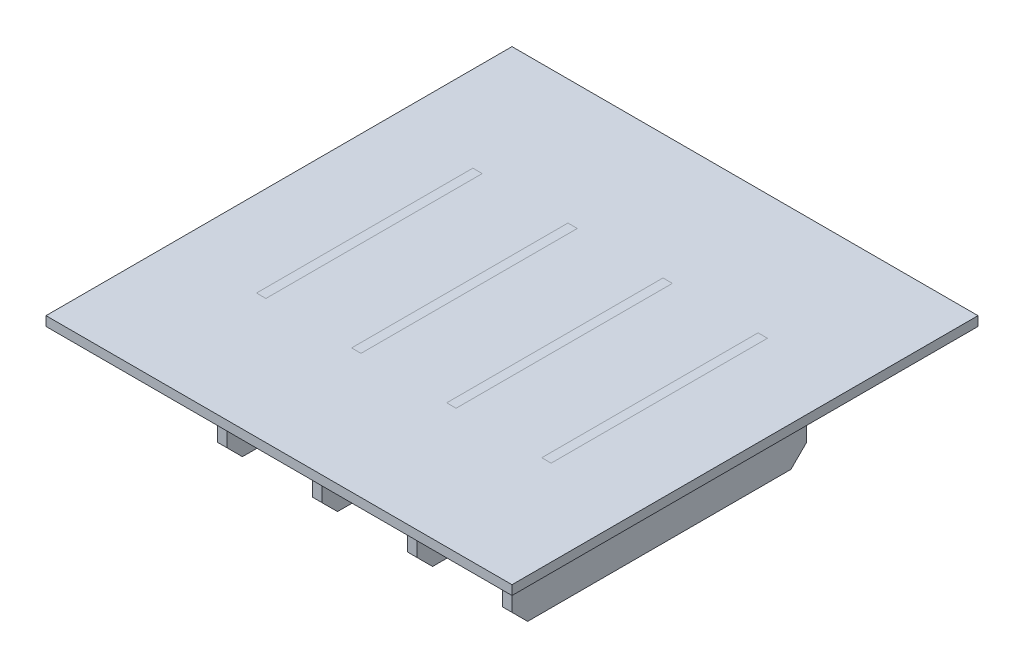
ISO-10303-21;
HEADER;
FILE_DESCRIPTION(('STEP AP214'),'2;1');
FILE_NAME('part.step','',(''),(''),'','','');
FILE_SCHEMA(('AUTOMOTIVE_DESIGN { 1 0 10303 214 1 1 1 1 }'));
ENDSEC;
DATA;
#1=APPLICATION_CONTEXT('core data for automotive mechanical design processes');
#2=APPLICATION_PROTOCOL_DEFINITION('international standard','automotive_design',2000,#1);
#3=PRODUCT_CONTEXT('',#1,'mechanical');
#4=PRODUCT('Part','Part','',(#3));
#5=PRODUCT_RELATED_PRODUCT_CATEGORY('part','',(#4));
#6=PRODUCT_DEFINITION_FORMATION('','',#4);
#7=PRODUCT_DEFINITION_CONTEXT('part definition',#1,'design');
#8=PRODUCT_DEFINITION('design','',#6,#7);
#9=PRODUCT_DEFINITION_SHAPE('','',#8);
#10=(LENGTH_UNIT() NAMED_UNIT(*) SI_UNIT(.MILLI.,.METRE.));
#11=(NAMED_UNIT(*) PLANE_ANGLE_UNIT() SI_UNIT($,.RADIAN.));
#12=(NAMED_UNIT(*) SI_UNIT($,.STERADIAN.) SOLID_ANGLE_UNIT());
#13=UNCERTAINTY_MEASURE_WITH_UNIT(LENGTH_MEASURE(1.E-05),#10,'distance_accuracy_value','');
#14=(GEOMETRIC_REPRESENTATION_CONTEXT(3) GLOBAL_UNCERTAINTY_ASSIGNED_CONTEXT((#13)) GLOBAL_UNIT_ASSIGNED_CONTEXT((#10,
#11,#12)) REPRESENTATION_CONTEXT('',''));
#15=CARTESIAN_POINT('',(0.,0.,0.));
#16=DIRECTION('',(0.,0.,1.));
#17=DIRECTION('',(1.,0.,0.));
#18=AXIS2_PLACEMENT_3D('',#15,#16,#17);
#19=CARTESIAN_POINT('',(364.2,0.,0.));
#20=DIRECTION('',(0.,-1.,0.));
#21=DIRECTION('',(0.,0.,-1.));
#22=AXIS2_PLACEMENT_3D('',#19,#20,#21);
#23=PLANE('',#22);
#24=DIRECTION('',(1.,0.,0.));
#25=VECTOR('',#24,1.);
#26=CARTESIAN_POINT('',(176.1,0.,138.1));
#27=LINE('',#26,#25);
#28=CARTESIAN_POINT('',(176.1,0.,138.1));
#29=VERTEX_POINT('',#28);
#30=CARTESIAN_POINT('',(188.1,0.,138.1));
#31=VERTEX_POINT('',#30);
#32=EDGE_CURVE('E162',#29,#31,#27,.T.);
#33=ORIENTED_EDGE('',*,*,#32,.F.);
#34=DIRECTION('',(0.,0.,-1.));
#35=VECTOR('',#34,1.);
#36=CARTESIAN_POINT('',(176.1,0.,-188.1));
#37=LINE('',#36,#35);
#38=CARTESIAN_POINT('',(176.1,0.,188.1));
#39=VERTEX_POINT('',#38);
#40=EDGE_CURVE('E174',#39,#29,#37,.T.);
#41=ORIENTED_EDGE('',*,*,#40,.F.);
#42=DIRECTION('',(-1.,0.,0.));
#43=VECTOR('',#42,1.);
#44=CARTESIAN_POINT('',(188.1,0.,188.1));
#45=LINE('',#44,#43);
#46=CARTESIAN_POINT('',(188.1,0.,188.1));
#47=VERTEX_POINT('',#46);
#48=EDGE_CURVE('E186',#47,#39,#45,.T.);
#49=ORIENTED_EDGE('',*,*,#48,.F.);
#50=DIRECTION('',(0.,0.,1.));
#51=VECTOR('',#50,1.);
#52=CARTESIAN_POINT('',(188.1,0.,-188.1));
#53=LINE('',#52,#51);
#54=EDGE_CURVE('E79',#31,#47,#53,.T.);
#55=ORIENTED_EDGE('',*,*,#54,.F.);
#56=EDGE_LOOP('',(#33,#41,#49,#55));
#57=FACE_BOUND('',#56,.T.);
#58=ADVANCED_FACE('F62',(#57),#23,.F.);
#59=DIRECTION('',(-1.,0.,0.));
#60=VECTOR('',#59,1.);
#61=CARTESIAN_POINT('',(176.1,0.,-138.1));
#62=LINE('',#61,#60);
#63=CARTESIAN_POINT('',(188.1,0.,-138.1));
#64=VERTEX_POINT('',#63);
#65=CARTESIAN_POINT('',(176.1,0.,-138.1));
#66=VERTEX_POINT('',#65);
#67=EDGE_CURVE('E87',#64,#66,#62,.T.);
#68=ORIENTED_EDGE('',*,*,#67,.F.);
#69=CARTESIAN_POINT('',(188.1,0.,-188.1));
#70=VERTEX_POINT('',#69);
#71=EDGE_CURVE('E166',#70,#64,#53,.T.);
#72=ORIENTED_EDGE('',*,*,#71,.F.);
#73=DIRECTION('',(1.,0.,0.));
#74=VECTOR('',#73,1.);
#75=CARTESIAN_POINT('',(188.1,0.,-188.1));
#76=LINE('',#75,#74);
#77=CARTESIAN_POINT('',(176.1,0.,-188.1));
#78=VERTEX_POINT('',#77);
#79=EDGE_CURVE('E193',#78,#70,#76,.T.);
#80=ORIENTED_EDGE('',*,*,#79,.F.);
#81=EDGE_CURVE('E168',#66,#78,#37,.T.);
#82=ORIENTED_EDGE('',*,*,#81,.F.);
#83=EDGE_LOOP('',(#68,#72,#80,#82));
#84=FACE_BOUND('',#83,.T.);
#85=ADVANCED_FACE('F251',(#84),#23,.F.);
#86=CARTESIAN_POINT('',(176.1,-148.,-188.1));
#87=DIRECTION('',(1.,0.,0.));
#88=DIRECTION('',(0.,0.,-1.));
#89=AXIS2_PLACEMENT_3D('',#86,#87,#88);
#90=PLANE('',#89);
#91=DIRECTION('',(0.,1.,0.));
#92=VECTOR('',#91,1.);
#93=CARTESIAN_POINT('',(176.1,-148.,-188.1));
#94=LINE('',#93,#92);
#95=CARTESIAN_POINT('',(176.1,-128.,-188.1));
#96=VERTEX_POINT('',#95);
#97=EDGE_CURVE('E211',#96,#78,#94,.T.);
#98=ORIENTED_EDGE('',*,*,#97,.F.);
#99=DIRECTION('',(0.,-0.70710678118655,0.707106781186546));
#100=VECTOR('',#99,1.);
#101=CARTESIAN_POINT('',(176.1,-148.,-168.1));
#102=LINE('',#101,#100);
#103=CARTESIAN_POINT('',(176.1,-148.,-168.1));
#104=VERTEX_POINT('',#103);
#105=EDGE_CURVE('E72',#96,#104,#102,.T.);
#106=ORIENTED_EDGE('',*,*,#105,.T.);
#107=DIRECTION('',(0.,0.,-1.));
#108=VECTOR('',#107,1.);
#109=CARTESIAN_POINT('',(176.1,-148.,-188.1));
#110=LINE('',#109,#108);
#111=CARTESIAN_POINT('',(176.1,-148.,168.1));
#112=VERTEX_POINT('',#111);
#113=EDGE_CURVE('E181',#112,#104,#110,.T.);
#114=ORIENTED_EDGE('',*,*,#113,.F.);
#115=DIRECTION('',(0.,0.70710678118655,0.707106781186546));
#116=VECTOR('',#115,1.);
#117=CARTESIAN_POINT('',(176.1,-148.,168.1));
#118=LINE('',#117,#116);
#119=CARTESIAN_POINT('',(176.1,-128.,188.1));
#120=VERTEX_POINT('',#119);
#121=EDGE_CURVE('E230',#112,#120,#118,.T.);
#122=ORIENTED_EDGE('',*,*,#121,.T.);
#123=DIRECTION('',(0.,1.,0.));
#124=VECTOR('',#123,1.);
#125=CARTESIAN_POINT('',(176.1,-148.,188.1));
#126=LINE('',#125,#124);
#127=EDGE_CURVE('E189',#120,#39,#126,.T.);
#128=ORIENTED_EDGE('',*,*,#127,.T.);
#129=ORIENTED_EDGE('',*,*,#40,.T.);
#130=DIRECTION('',(0.,-1.,0.));
#131=VECTOR('',#130,1.);
#132=CARTESIAN_POINT('',(176.1,12.,138.1));
#133=LINE('',#132,#131);
#134=CARTESIAN_POINT('',(176.1,12.,138.1));
#135=VERTEX_POINT('',#134);
#136=EDGE_CURVE('E177',#135,#29,#133,.T.);
#137=ORIENTED_EDGE('',*,*,#136,.F.);
#138=DIRECTION('',(0.,0.,1.));
#139=VECTOR('',#138,1.);
#140=CARTESIAN_POINT('',(176.1,12.,138.1));
#141=LINE('',#140,#139);
#142=CARTESIAN_POINT('',(176.1,12.,-138.1));
#143=VERTEX_POINT('',#142);
#144=EDGE_CURVE('E151',#143,#135,#141,.T.);
#145=ORIENTED_EDGE('',*,*,#144,.F.);
#146=DIRECTION('',(0.,-1.,0.));
#147=VECTOR('',#146,1.);
#148=CARTESIAN_POINT('',(176.1,12.,-138.1));
#149=LINE('',#148,#147);
#150=EDGE_CURVE('E147',#143,#66,#149,.T.);
#151=ORIENTED_EDGE('',*,*,#150,.T.);
#152=ORIENTED_EDGE('',*,*,#81,.T.);
#153=EDGE_LOOP('',(#98,#106,#114,#122,#128,#129,#137,#145,#151,#152));
#154=FACE_BOUND('',#153,.T.);
#155=ADVANCED_FACE('F239',(#154),#90,.F.);
#156=CARTESIAN_POINT('',(188.1,-148.,-188.1));
#157=DIRECTION('',(0.,0.,1.));
#158=DIRECTION('',(1.,0.,0.));
#159=AXIS2_PLACEMENT_3D('',#156,#157,#158);
#160=PLANE('',#159);
#161=DIRECTION('',(0.,1.,0.));
#162=VECTOR('',#161,1.);
#163=CARTESIAN_POINT('',(188.1,-148.,-188.1));
#164=LINE('',#163,#162);
#165=CARTESIAN_POINT('',(188.1,-128.,-188.1));
#166=VERTEX_POINT('',#165);
#167=EDGE_CURVE('E208',#166,#70,#164,.T.);
#168=ORIENTED_EDGE('',*,*,#167,.F.);
#169=DIRECTION('',(-1.,0.,0.));
#170=VECTOR('',#169,1.);
#171=CARTESIAN_POINT('',(176.1,-128.,-188.1));
#172=LINE('',#171,#170);
#173=EDGE_CURVE('E228',#166,#96,#172,.T.);
#174=ORIENTED_EDGE('',*,*,#173,.T.);
#175=ORIENTED_EDGE('',*,*,#97,.T.);
#176=ORIENTED_EDGE('',*,*,#79,.T.);
#177=EDGE_LOOP('',(#168,#174,#175,#176));
#178=FACE_BOUND('',#177,.T.);
#179=ADVANCED_FACE('F249',(#178),#160,.F.);
#180=CARTESIAN_POINT('',(188.1,-148.,-188.1));
#181=DIRECTION('',(-1.,0.,0.));
#182=DIRECTION('',(0.,0.,1.));
#183=AXIS2_PLACEMENT_3D('',#180,#181,#182);
#184=PLANE('',#183);
#185=DIRECTION('',(0.,0.,1.));
#186=VECTOR('',#185,1.);
#187=CARTESIAN_POINT('',(188.1,-148.,-188.1));
#188=LINE('',#187,#186);
#189=CARTESIAN_POINT('',(188.1,-148.,-168.1));
#190=VERTEX_POINT('',#189);
#191=CARTESIAN_POINT('',(188.1,-148.,168.1));
#192=VERTEX_POINT('',#191);
#193=EDGE_CURVE('E185',#190,#192,#188,.T.);
#194=ORIENTED_EDGE('',*,*,#193,.F.);
#195=DIRECTION('',(0.,0.70710678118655,-0.707106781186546));
#196=VECTOR('',#195,1.);
#197=CARTESIAN_POINT('',(188.1,-148.,-168.1));
#198=LINE('',#197,#196);
#199=EDGE_CURVE('E225',#190,#166,#198,.T.);
#200=ORIENTED_EDGE('',*,*,#199,.T.);
#201=ORIENTED_EDGE('',*,*,#167,.T.);
#202=ORIENTED_EDGE('',*,*,#71,.T.);
#203=DIRECTION('',(0.,-1.,0.));
#204=VECTOR('',#203,1.);
#205=CARTESIAN_POINT('',(188.1,12.,-138.1));
#206=LINE('',#205,#204);
#207=CARTESIAN_POINT('',(188.1,12.,-138.1));
#208=VERTEX_POINT('',#207);
#209=EDGE_CURVE('E145',#208,#64,#206,.T.);
#210=ORIENTED_EDGE('',*,*,#209,.F.);
#211=DIRECTION('',(0.,0.,-1.));
#212=VECTOR('',#211,1.);
#213=CARTESIAN_POINT('',(188.1,12.,138.1));
#214=LINE('',#213,#212);
#215=CARTESIAN_POINT('',(188.1,12.,138.1));
#216=VERTEX_POINT('',#215);
#217=EDGE_CURVE('E152',#216,#208,#214,.T.);
#218=ORIENTED_EDGE('',*,*,#217,.F.);
#219=DIRECTION('',(0.,-1.,0.));
#220=VECTOR('',#219,1.);
#221=CARTESIAN_POINT('',(188.1,12.,138.1));
#222=LINE('',#221,#220);
#223=EDGE_CURVE('E367',#216,#31,#222,.T.);
#224=ORIENTED_EDGE('',*,*,#223,.T.);
#225=ORIENTED_EDGE('',*,*,#54,.T.);
#226=DIRECTION('',(0.,1.,0.));
#227=VECTOR('',#226,1.);
#228=CARTESIAN_POINT('',(188.1,-148.,188.1));
#229=LINE('',#228,#227);
#230=CARTESIAN_POINT('',(188.1,-128.,188.1));
#231=VERTEX_POINT('',#230);
#232=EDGE_CURVE('E204',#231,#47,#229,.T.);
#233=ORIENTED_EDGE('',*,*,#232,.F.);
#234=DIRECTION('',(0.,-0.70710678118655,-0.707106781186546));
#235=VECTOR('',#234,1.);
#236=CARTESIAN_POINT('',(188.1,-148.,168.1));
#237=LINE('',#236,#235);
#238=EDGE_CURVE('E223',#231,#192,#237,.T.);
#239=ORIENTED_EDGE('',*,*,#238,.T.);
#240=EDGE_LOOP('',(#194,#200,#201,#202,#210,#218,#224,#225,#233,#239));
#241=FACE_BOUND('',#240,.T.);
#242=ADVANCED_FACE('F165',(#241),#184,.F.);
#243=CARTESIAN_POINT('',(188.1,-148.,188.1));
#244=DIRECTION('',(0.,0.,-1.));
#245=DIRECTION('',(-1.,0.,0.));
#246=AXIS2_PLACEMENT_3D('',#243,#244,#245);
#247=PLANE('',#246);
#248=ORIENTED_EDGE('',*,*,#127,.F.);
#249=DIRECTION('',(1.,0.,0.));
#250=VECTOR('',#249,1.);
#251=CARTESIAN_POINT('',(188.1,-128.,188.1));
#252=LINE('',#251,#250);
#253=EDGE_CURVE('E12',#120,#231,#252,.T.);
#254=ORIENTED_EDGE('',*,*,#253,.T.);
#255=ORIENTED_EDGE('',*,*,#232,.T.);
#256=ORIENTED_EDGE('',*,*,#48,.T.);
#257=EDGE_LOOP('',(#248,#254,#255,#256));
#258=FACE_BOUND('',#257,.T.);
#259=ADVANCED_FACE('F261',(#258),#247,.F.);
#260=CARTESIAN_POINT('',(364.2,-148.,0.));
#261=DIRECTION('',(0.,-1.,0.));
#262=DIRECTION('',(0.,0.,-1.));
#263=AXIS2_PLACEMENT_3D('',#260,#261,#262);
#264=PLANE('',#263);
#265=ORIENTED_EDGE('',*,*,#113,.T.);
#266=DIRECTION('',(1.,0.,0.));
#267=VECTOR('',#266,1.);
#268=CARTESIAN_POINT('',(188.1,-148.,-168.1));
#269=LINE('',#268,#267);
#270=EDGE_CURVE('E219',#104,#190,#269,.T.);
#271=ORIENTED_EDGE('',*,*,#270,.T.);
#272=ORIENTED_EDGE('',*,*,#193,.T.);
#273=DIRECTION('',(-1.,0.,0.));
#274=VECTOR('',#273,1.);
#275=CARTESIAN_POINT('',(176.1,-148.,168.1));
#276=LINE('',#275,#274);
#277=EDGE_CURVE('E215',#192,#112,#276,.T.);
#278=ORIENTED_EDGE('',*,*,#277,.T.);
#279=EDGE_LOOP('',(#265,#271,#272,#278));
#280=FACE_BOUND('',#279,.T.);
#281=ADVANCED_FACE('F244',(#280),#264,.T.);
#282=CARTESIAN_POINT('',(364.2,-148.,-168.1));
#283=DIRECTION('',(0.,-0.707106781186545,-0.707106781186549));
#284=DIRECTION('',(-1.,0.,0.));
#285=AXIS2_PLACEMENT_3D('',#282,#283,#284);
#286=PLANE('',#285);
#287=ORIENTED_EDGE('',*,*,#105,.F.);
#288=ORIENTED_EDGE('',*,*,#173,.F.);
#289=ORIENTED_EDGE('',*,*,#199,.F.);
#290=ORIENTED_EDGE('',*,*,#270,.F.);
#291=EDGE_LOOP('',(#287,#288,#289,#290));
#292=FACE_BOUND('',#291,.T.);
#293=ADVANCED_FACE('F246',(#292),#286,.T.);
#294=CARTESIAN_POINT('',(364.2,-148.,168.1));
#295=DIRECTION('',(0.,-0.707106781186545,0.707106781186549));
#296=DIRECTION('',(1.,0.,0.));
#297=AXIS2_PLACEMENT_3D('',#294,#295,#296);
#298=PLANE('',#297);
#299=ORIENTED_EDGE('',*,*,#238,.F.);
#300=ORIENTED_EDGE('',*,*,#253,.F.);
#301=ORIENTED_EDGE('',*,*,#121,.F.);
#302=ORIENTED_EDGE('',*,*,#277,.F.);
#303=EDGE_LOOP('',(#299,#300,#301,#302));
#304=FACE_BOUND('',#303,.T.);
#305=ADVANCED_FACE('F65',(#304),#298,.T.);
#306=CARTESIAN_POINT('',(176.1,12.,-138.1));
#307=DIRECTION('',(0.,0.,1.));
#308=DIRECTION('',(1.,0.,0.));
#309=AXIS2_PLACEMENT_3D('',#306,#307,#308);
#310=PLANE('',#309);
#311=ORIENTED_EDGE('',*,*,#67,.T.);
#312=ORIENTED_EDGE('',*,*,#150,.F.);
#313=DIRECTION('',(-1.,0.,0.));
#314=VECTOR('',#313,1.);
#315=CARTESIAN_POINT('',(176.1,12.,-138.1));
#316=LINE('',#315,#314);
#317=EDGE_CURVE('E141',#208,#143,#316,.T.);
#318=ORIENTED_EDGE('',*,*,#317,.F.);
#319=ORIENTED_EDGE('',*,*,#209,.T.);
#320=EDGE_LOOP('',(#311,#312,#318,#319));
#321=FACE_BOUND('',#320,.T.);
#322=ADVANCED_FACE('F143',(#321),#310,.F.);
#323=CARTESIAN_POINT('',(176.1,12.,138.1));
#324=DIRECTION('',(0.,0.,-1.));
#325=DIRECTION('',(-1.,0.,0.));
#326=AXIS2_PLACEMENT_3D('',#323,#324,#325);
#327=PLANE('',#326);
#328=ORIENTED_EDGE('',*,*,#32,.T.);
#329=ORIENTED_EDGE('',*,*,#223,.F.);
#330=DIRECTION('',(1.,0.,0.));
#331=VECTOR('',#330,1.);
#332=CARTESIAN_POINT('',(176.1,12.,138.1));
#333=LINE('',#332,#331);
#334=EDGE_CURVE('E157',#135,#216,#333,.T.);
#335=ORIENTED_EDGE('',*,*,#334,.F.);
#336=ORIENTED_EDGE('',*,*,#136,.T.);
#337=EDGE_LOOP('',(#328,#329,#335,#336));
#338=FACE_BOUND('',#337,.T.);
#339=ADVANCED_FACE('F341',(#338),#327,.F.);
#340=CARTESIAN_POINT('',(364.2,12.,0.));
#341=DIRECTION('',(0.,-1.,0.));
#342=DIRECTION('',(0.,0.,-1.));
#343=AXIS2_PLACEMENT_3D('',#340,#341,#342);
#344=PLANE('',#343);
#345=ORIENTED_EDGE('',*,*,#217,.T.);
#346=ORIENTED_EDGE('',*,*,#317,.T.);
#347=ORIENTED_EDGE('',*,*,#144,.T.);
#348=ORIENTED_EDGE('',*,*,#334,.T.);
#349=EDGE_LOOP('',(#345,#346,#347,#348));
#350=FACE_BOUND('',#349,.T.);
#351=ADVANCED_FACE('F155',(#350),#344,.F.);
#352=CLOSED_SHELL('',(#58,#85,#155,#179,#242,#259,#281,#293,#305,#322,#339,#351));
#353=MANIFOLD_SOLID_BREP('B2',#352);
#354=CARTESIAN_POINT('',(242.8,0.,0.));
#355=DIRECTION('',(0.,-1.,0.));
#356=DIRECTION('',(0.,0.,-1.));
#357=AXIS2_PLACEMENT_3D('',#354,#355,#356);
#358=PLANE('',#357);
#359=DIRECTION('',(1.,0.,0.));
#360=VECTOR('',#359,1.);
#361=CARTESIAN_POINT('',(54.6999999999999,0.,138.1));
#362=LINE('',#361,#360);
#363=CARTESIAN_POINT('',(54.6999999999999,0.,138.1));
#364=VERTEX_POINT('',#363);
#365=CARTESIAN_POINT('',(66.6999999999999,0.,138.1));
#366=VERTEX_POINT('',#365);
#367=EDGE_CURVE('E563',#364,#366,#362,.T.);
#368=ORIENTED_EDGE('',*,*,#367,.F.);
#369=DIRECTION('',(0.,0.,-1.));
#370=VECTOR('',#369,1.);
#371=CARTESIAN_POINT('',(54.6999999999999,0.,-188.1));
#372=LINE('',#371,#370);
#373=CARTESIAN_POINT('',(54.6999999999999,0.,188.1));
#374=VERTEX_POINT('',#373);
#375=EDGE_CURVE('E574',#374,#364,#372,.T.);
#376=ORIENTED_EDGE('',*,*,#375,.F.);
#377=DIRECTION('',(-1.,0.,0.));
#378=VECTOR('',#377,1.);
#379=CARTESIAN_POINT('',(66.6999999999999,0.,188.1));
#380=LINE('',#379,#378);
#381=CARTESIAN_POINT('',(66.6999999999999,0.,188.1));
#382=VERTEX_POINT('',#381);
#383=EDGE_CURVE('E586',#382,#374,#380,.T.);
#384=ORIENTED_EDGE('',*,*,#383,.F.);
#385=DIRECTION('',(0.,0.,1.));
#386=VECTOR('',#385,1.);
#387=CARTESIAN_POINT('',(66.6999999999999,0.,-188.1));
#388=LINE('',#387,#386);
#389=EDGE_CURVE('E480',#366,#382,#388,.T.);
#390=ORIENTED_EDGE('',*,*,#389,.F.);
#391=EDGE_LOOP('',(#368,#376,#384,#390));
#392=FACE_BOUND('',#391,.T.);
#393=ADVANCED_FACE('F463',(#392),#358,.F.);
#394=DIRECTION('',(-1.,0.,0.));
#395=VECTOR('',#394,1.);
#396=CARTESIAN_POINT('',(54.6999999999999,0.,-138.1));
#397=LINE('',#396,#395);
#398=CARTESIAN_POINT('',(66.6999999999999,0.,-138.1));
#399=VERTEX_POINT('',#398);
#400=CARTESIAN_POINT('',(54.6999999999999,0.,-138.1));
#401=VERTEX_POINT('',#400);
#402=EDGE_CURVE('E488',#399,#401,#397,.T.);
#403=ORIENTED_EDGE('',*,*,#402,.F.);
#404=CARTESIAN_POINT('',(66.6999999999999,0.,-188.1));
#405=VERTEX_POINT('',#404);
#406=EDGE_CURVE('E567',#405,#399,#388,.T.);
#407=ORIENTED_EDGE('',*,*,#406,.F.);
#408=DIRECTION('',(1.,0.,0.));
#409=VECTOR('',#408,1.);
#410=CARTESIAN_POINT('',(66.6999999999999,0.,-188.1));
#411=LINE('',#410,#409);
#412=CARTESIAN_POINT('',(54.6999999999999,0.,-188.1));
#413=VERTEX_POINT('',#412);
#414=EDGE_CURVE('E593',#413,#405,#411,.T.);
#415=ORIENTED_EDGE('',*,*,#414,.F.);
#416=EDGE_CURVE('E569',#401,#413,#372,.T.);
#417=ORIENTED_EDGE('',*,*,#416,.F.);
#418=EDGE_LOOP('',(#403,#407,#415,#417));
#419=FACE_BOUND('',#418,.T.);
#420=ADVANCED_FACE('F653',(#419),#358,.F.);
#421=CARTESIAN_POINT('',(54.6999999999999,-148.,-188.1));
#422=DIRECTION('',(1.,0.,0.));
#423=DIRECTION('',(0.,0.,-1.));
#424=AXIS2_PLACEMENT_3D('',#421,#422,#423);
#425=PLANE('',#424);
#426=DIRECTION('',(0.,1.,0.));
#427=VECTOR('',#426,1.);
#428=CARTESIAN_POINT('',(54.6999999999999,-148.,-188.1));
#429=LINE('',#428,#427);
#430=CARTESIAN_POINT('',(54.6999999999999,-128.,-188.1));
#431=VERTEX_POINT('',#430);
#432=EDGE_CURVE('E611',#431,#413,#429,.T.);
#433=ORIENTED_EDGE('',*,*,#432,.F.);
#434=DIRECTION('',(0.,-0.70710678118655,0.707106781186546));
#435=VECTOR('',#434,1.);
#436=CARTESIAN_POINT('',(54.6999999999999,-148.,-168.1));
#437=LINE('',#436,#435);
#438=CARTESIAN_POINT('',(54.6999999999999,-148.,-168.1));
#439=VERTEX_POINT('',#438);
#440=EDGE_CURVE('E473',#431,#439,#437,.T.);
#441=ORIENTED_EDGE('',*,*,#440,.T.);
#442=DIRECTION('',(0.,0.,-1.));
#443=VECTOR('',#442,1.);
#444=CARTESIAN_POINT('',(54.6999999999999,-148.,-188.1));
#445=LINE('',#444,#443);
#446=CARTESIAN_POINT('',(54.6999999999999,-148.,168.1));
#447=VERTEX_POINT('',#446);
#448=EDGE_CURVE('E581',#447,#439,#445,.T.);
#449=ORIENTED_EDGE('',*,*,#448,.F.);
#450=DIRECTION('',(0.,0.70710678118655,0.707106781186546));
#451=VECTOR('',#450,1.);
#452=CARTESIAN_POINT('',(54.6999999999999,-148.,168.1));
#453=LINE('',#452,#451);
#454=CARTESIAN_POINT('',(54.6999999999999,-128.,188.1));
#455=VERTEX_POINT('',#454);
#456=EDGE_CURVE('E632',#447,#455,#453,.T.);
#457=ORIENTED_EDGE('',*,*,#456,.T.);
#458=DIRECTION('',(0.,1.,0.));
#459=VECTOR('',#458,1.);
#460=CARTESIAN_POINT('',(54.6999999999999,-148.,188.1));
#461=LINE('',#460,#459);
#462=EDGE_CURVE('E589',#455,#374,#461,.T.);
#463=ORIENTED_EDGE('',*,*,#462,.T.);
#464=ORIENTED_EDGE('',*,*,#375,.T.);
#465=DIRECTION('',(0.,-1.,0.));
#466=VECTOR('',#465,1.);
#467=CARTESIAN_POINT('',(54.6999999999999,12.,138.1));
#468=LINE('',#467,#466);
#469=CARTESIAN_POINT('',(54.6999999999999,12.,138.1));
#470=VERTEX_POINT('',#469);
#471=EDGE_CURVE('E577',#470,#364,#468,.T.);
#472=ORIENTED_EDGE('',*,*,#471,.F.);
#473=DIRECTION('',(0.,0.,1.));
#474=VECTOR('',#473,1.);
#475=CARTESIAN_POINT('',(54.6999999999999,12.,138.1));
#476=LINE('',#475,#474);
#477=CARTESIAN_POINT('',(54.6999999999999,12.,-138.1));
#478=VERTEX_POINT('',#477);
#479=EDGE_CURVE('E552',#478,#470,#476,.T.);
#480=ORIENTED_EDGE('',*,*,#479,.F.);
#481=DIRECTION('',(0.,-1.,0.));
#482=VECTOR('',#481,1.);
#483=CARTESIAN_POINT('',(54.6999999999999,12.,-138.1));
#484=LINE('',#483,#482);
#485=EDGE_CURVE('E548',#478,#401,#484,.T.);
#486=ORIENTED_EDGE('',*,*,#485,.T.);
#487=ORIENTED_EDGE('',*,*,#416,.T.);
#488=EDGE_LOOP('',(#433,#441,#449,#457,#463,#464,#472,#480,#486,#487));
#489=FACE_BOUND('',#488,.T.);
#490=ADVANCED_FACE('F641',(#489),#425,.F.);
#491=CARTESIAN_POINT('',(66.6999999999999,-148.,-188.1));
#492=DIRECTION('',(0.,0.,1.));
#493=DIRECTION('',(1.,0.,0.));
#494=AXIS2_PLACEMENT_3D('',#491,#492,#493);
#495=PLANE('',#494);
#496=DIRECTION('',(0.,1.,0.));
#497=VECTOR('',#496,1.);
#498=CARTESIAN_POINT('',(66.6999999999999,-148.,-188.1));
#499=LINE('',#498,#497);
#500=CARTESIAN_POINT('',(66.6999999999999,-128.,-188.1));
#501=VERTEX_POINT('',#500);
#502=EDGE_CURVE('E608',#501,#405,#499,.T.);
#503=ORIENTED_EDGE('',*,*,#502,.F.);
#504=DIRECTION('',(-1.,0.,0.));
#505=VECTOR('',#504,1.);
#506=CARTESIAN_POINT('',(54.6999999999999,-128.,-188.1));
#507=LINE('',#506,#505);
#508=EDGE_CURVE('E629',#501,#431,#507,.T.);
#509=ORIENTED_EDGE('',*,*,#508,.T.);
#510=ORIENTED_EDGE('',*,*,#432,.T.);
#511=ORIENTED_EDGE('',*,*,#414,.T.);
#512=EDGE_LOOP('',(#503,#509,#510,#511));
#513=FACE_BOUND('',#512,.T.);
#514=ADVANCED_FACE('F651',(#513),#495,.F.);
#515=CARTESIAN_POINT('',(66.6999999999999,-148.,-188.1));
#516=DIRECTION('',(-1.,0.,0.));
#517=DIRECTION('',(0.,0.,1.));
#518=AXIS2_PLACEMENT_3D('',#515,#516,#517);
#519=PLANE('',#518);
#520=DIRECTION('',(0.,0.,1.));
#521=VECTOR('',#520,1.);
#522=CARTESIAN_POINT('',(66.6999999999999,-148.,-188.1));
#523=LINE('',#522,#521);
#524=CARTESIAN_POINT('',(66.6999999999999,-148.,-168.1));
#525=VERTEX_POINT('',#524);
#526=CARTESIAN_POINT('',(66.6999999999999,-148.,168.1));
#527=VERTEX_POINT('',#526);
#528=EDGE_CURVE('E585',#525,#527,#523,.T.);
#529=ORIENTED_EDGE('',*,*,#528,.F.);
#530=DIRECTION('',(0.,0.70710678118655,-0.707106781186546));
#531=VECTOR('',#530,1.);
#532=CARTESIAN_POINT('',(66.6999999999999,-148.,-168.1));
#533=LINE('',#532,#531);
#534=EDGE_CURVE('E626',#525,#501,#533,.T.);
#535=ORIENTED_EDGE('',*,*,#534,.T.);
#536=ORIENTED_EDGE('',*,*,#502,.T.);
#537=ORIENTED_EDGE('',*,*,#406,.T.);
#538=DIRECTION('',(0.,-1.,0.));
#539=VECTOR('',#538,1.);
#540=CARTESIAN_POINT('',(66.6999999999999,12.,-138.1));
#541=LINE('',#540,#539);
#542=CARTESIAN_POINT('',(66.6999999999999,12.,-138.1));
#543=VERTEX_POINT('',#542);
#544=EDGE_CURVE('E546',#543,#399,#541,.T.);
#545=ORIENTED_EDGE('',*,*,#544,.F.);
#546=DIRECTION('',(0.,0.,-1.));
#547=VECTOR('',#546,1.);
#548=CARTESIAN_POINT('',(66.6999999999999,12.,138.1));
#549=LINE('',#548,#547);
#550=CARTESIAN_POINT('',(66.6999999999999,12.,138.1));
#551=VERTEX_POINT('',#550);
#552=EDGE_CURVE('E553',#551,#543,#549,.T.);
#553=ORIENTED_EDGE('',*,*,#552,.F.);
#554=DIRECTION('',(0.,-1.,0.));
#555=VECTOR('',#554,1.);
#556=CARTESIAN_POINT('',(66.6999999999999,12.,138.1));
#557=LINE('',#556,#555);
#558=EDGE_CURVE('E769',#551,#366,#557,.T.);
#559=ORIENTED_EDGE('',*,*,#558,.T.);
#560=ORIENTED_EDGE('',*,*,#389,.T.);
#561=DIRECTION('',(0.,1.,0.));
#562=VECTOR('',#561,1.);
#563=CARTESIAN_POINT('',(66.6999999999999,-148.,188.1));
#564=LINE('',#563,#562);
#565=CARTESIAN_POINT('',(66.6999999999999,-128.,188.1));
#566=VERTEX_POINT('',#565);
#567=EDGE_CURVE('E604',#566,#382,#564,.T.);
#568=ORIENTED_EDGE('',*,*,#567,.F.);
#569=DIRECTION('',(0.,-0.70710678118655,-0.707106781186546));
#570=VECTOR('',#569,1.);
#571=CARTESIAN_POINT('',(66.6999999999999,-148.,168.1));
#572=LINE('',#571,#570);
#573=EDGE_CURVE('E623',#566,#527,#572,.T.);
#574=ORIENTED_EDGE('',*,*,#573,.T.);
#575=EDGE_LOOP('',(#529,#535,#536,#537,#545,#553,#559,#560,#568,#574));
#576=FACE_BOUND('',#575,.T.);
#577=ADVANCED_FACE('F566',(#576),#519,.F.);
#578=CARTESIAN_POINT('',(66.6999999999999,-148.,188.1));
#579=DIRECTION('',(0.,0.,-1.));
#580=DIRECTION('',(-1.,0.,0.));
#581=AXIS2_PLACEMENT_3D('',#578,#579,#580);
#582=PLANE('',#581);
#583=ORIENTED_EDGE('',*,*,#462,.F.);
#584=DIRECTION('',(1.,0.,0.));
#585=VECTOR('',#584,1.);
#586=CARTESIAN_POINT('',(66.6999999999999,-128.,188.1));
#587=LINE('',#586,#585);
#588=EDGE_CURVE('E60',#455,#566,#587,.T.);
#589=ORIENTED_EDGE('',*,*,#588,.T.);
#590=ORIENTED_EDGE('',*,*,#567,.T.);
#591=ORIENTED_EDGE('',*,*,#383,.T.);
#592=EDGE_LOOP('',(#583,#589,#590,#591));
#593=FACE_BOUND('',#592,.T.);
#594=ADVANCED_FACE('F663',(#593),#582,.F.);
#595=CARTESIAN_POINT('',(242.8,-148.,0.));
#596=DIRECTION('',(0.,-1.,0.));
#597=DIRECTION('',(0.,0.,-1.));
#598=AXIS2_PLACEMENT_3D('',#595,#596,#597);
#599=PLANE('',#598);
#600=ORIENTED_EDGE('',*,*,#448,.T.);
#601=DIRECTION('',(1.,0.,0.));
#602=VECTOR('',#601,1.);
#603=CARTESIAN_POINT('',(66.6999999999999,-148.,-168.1));
#604=LINE('',#603,#602);
#605=EDGE_CURVE('E619',#439,#525,#604,.T.);
#606=ORIENTED_EDGE('',*,*,#605,.T.);
#607=ORIENTED_EDGE('',*,*,#528,.T.);
#608=DIRECTION('',(-1.,0.,0.));
#609=VECTOR('',#608,1.);
#610=CARTESIAN_POINT('',(54.6999999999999,-148.,168.1));
#611=LINE('',#610,#609);
#612=EDGE_CURVE('E615',#527,#447,#611,.T.);
#613=ORIENTED_EDGE('',*,*,#612,.T.);
#614=EDGE_LOOP('',(#600,#606,#607,#613));
#615=FACE_BOUND('',#614,.T.);
#616=ADVANCED_FACE('F646',(#615),#599,.T.);
#617=CARTESIAN_POINT('',(242.8,-148.,-168.1));
#618=DIRECTION('',(0.,-0.707106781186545,-0.707106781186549));
#619=DIRECTION('',(-1.,0.,0.));
#620=AXIS2_PLACEMENT_3D('',#617,#618,#619);
#621=PLANE('',#620);
#622=ORIENTED_EDGE('',*,*,#440,.F.);
#623=ORIENTED_EDGE('',*,*,#508,.F.);
#624=ORIENTED_EDGE('',*,*,#534,.F.);
#625=ORIENTED_EDGE('',*,*,#605,.F.);
#626=EDGE_LOOP('',(#622,#623,#624,#625));
#627=FACE_BOUND('',#626,.T.);
#628=ADVANCED_FACE('F648',(#627),#621,.T.);
#629=CARTESIAN_POINT('',(242.8,-148.,168.1));
#630=DIRECTION('',(0.,-0.707106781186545,0.707106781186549));
#631=DIRECTION('',(1.,0.,0.));
#632=AXIS2_PLACEMENT_3D('',#629,#630,#631);
#633=PLANE('',#632);
#634=ORIENTED_EDGE('',*,*,#573,.F.);
#635=ORIENTED_EDGE('',*,*,#588,.F.);
#636=ORIENTED_EDGE('',*,*,#456,.F.);
#637=ORIENTED_EDGE('',*,*,#612,.F.);
#638=EDGE_LOOP('',(#634,#635,#636,#637));
#639=FACE_BOUND('',#638,.T.);
#640=ADVANCED_FACE('F466',(#639),#633,.T.);
#641=CARTESIAN_POINT('',(54.6999999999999,12.,-138.1));
#642=DIRECTION('',(0.,0.,1.));
#643=DIRECTION('',(1.,0.,0.));
#644=AXIS2_PLACEMENT_3D('',#641,#642,#643);
#645=PLANE('',#644);
#646=ORIENTED_EDGE('',*,*,#402,.T.);
#647=ORIENTED_EDGE('',*,*,#485,.F.);
#648=DIRECTION('',(-1.,0.,0.));
#649=VECTOR('',#648,1.);
#650=CARTESIAN_POINT('',(54.6999999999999,12.,-138.1));
#651=LINE('',#650,#649);
#652=EDGE_CURVE('E542',#543,#478,#651,.T.);
#653=ORIENTED_EDGE('',*,*,#652,.F.);
#654=ORIENTED_EDGE('',*,*,#544,.T.);
#655=EDGE_LOOP('',(#646,#647,#653,#654));
#656=FACE_BOUND('',#655,.T.);
#657=ADVANCED_FACE('F544',(#656),#645,.F.);
#658=CARTESIAN_POINT('',(54.6999999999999,12.,138.1));
#659=DIRECTION('',(0.,0.,-1.));
#660=DIRECTION('',(-1.,0.,0.));
#661=AXIS2_PLACEMENT_3D('',#658,#659,#660);
#662=PLANE('',#661);
#663=ORIENTED_EDGE('',*,*,#367,.T.);
#664=ORIENTED_EDGE('',*,*,#558,.F.);
#665=DIRECTION('',(1.,0.,0.));
#666=VECTOR('',#665,1.);
#667=CARTESIAN_POINT('',(54.6999999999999,12.,138.1));
#668=LINE('',#667,#666);
#669=EDGE_CURVE('E558',#470,#551,#668,.T.);
#670=ORIENTED_EDGE('',*,*,#669,.F.);
#671=ORIENTED_EDGE('',*,*,#471,.T.);
#672=EDGE_LOOP('',(#663,#664,#670,#671));
#673=FACE_BOUND('',#672,.T.);
#674=ADVANCED_FACE('F743',(#673),#662,.F.);
#675=CARTESIAN_POINT('',(242.8,12.,0.));
#676=DIRECTION('',(0.,-1.,0.));
#677=DIRECTION('',(0.,0.,-1.));
#678=AXIS2_PLACEMENT_3D('',#675,#676,#677);
#679=PLANE('',#678);
#680=ORIENTED_EDGE('',*,*,#552,.T.);
#681=ORIENTED_EDGE('',*,*,#652,.T.);
#682=ORIENTED_EDGE('',*,*,#479,.T.);
#683=ORIENTED_EDGE('',*,*,#669,.T.);
#684=EDGE_LOOP('',(#680,#681,#682,#683));
#685=FACE_BOUND('',#684,.T.);
#686=ADVANCED_FACE('F556',(#685),#679,.F.);
#687=CLOSED_SHELL('',(#393,#420,#490,#514,#577,#594,#616,#628,#640,#657,#674,#686));
#688=MANIFOLD_SOLID_BREP('B6',#687);
#689=CARTESIAN_POINT('',(121.4,0.,0.));
#690=DIRECTION('',(0.,-1.,0.));
#691=DIRECTION('',(0.,0.,-1.));
#692=AXIS2_PLACEMENT_3D('',#689,#690,#691);
#693=PLANE('',#692);
#694=DIRECTION('',(1.,0.,0.));
#695=VECTOR('',#694,1.);
#696=CARTESIAN_POINT('',(-66.7000000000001,0.,138.1));
#697=LINE('',#696,#695);
#698=CARTESIAN_POINT('',(-66.7000000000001,0.,138.1));
#699=VERTEX_POINT('',#698);
#700=CARTESIAN_POINT('',(-54.7000000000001,0.,138.1));
#701=VERTEX_POINT('',#700);
#702=EDGE_CURVE('E964',#699,#701,#697,.T.);
#703=ORIENTED_EDGE('',*,*,#702,.F.);
#704=DIRECTION('',(0.,0.,-1.));
#705=VECTOR('',#704,1.);
#706=CARTESIAN_POINT('',(-66.7000000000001,0.,-188.1));
#707=LINE('',#706,#705);
#708=CARTESIAN_POINT('',(-66.7000000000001,0.,188.1));
#709=VERTEX_POINT('',#708);
#710=EDGE_CURVE('E975',#709,#699,#707,.T.);
#711=ORIENTED_EDGE('',*,*,#710,.F.);
#712=DIRECTION('',(-1.,0.,0.));
#713=VECTOR('',#712,1.);
#714=CARTESIAN_POINT('',(-54.7000000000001,0.,188.1));
#715=LINE('',#714,#713);
#716=CARTESIAN_POINT('',(-54.7000000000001,0.,188.1));
#717=VERTEX_POINT('',#716);
#718=EDGE_CURVE('E987',#717,#709,#715,.T.);
#719=ORIENTED_EDGE('',*,*,#718,.F.);
#720=DIRECTION('',(0.,0.,1.));
#721=VECTOR('',#720,1.);
#722=CARTESIAN_POINT('',(-54.7000000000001,0.,-188.1));
#723=LINE('',#722,#721);
#724=EDGE_CURVE('E881',#701,#717,#723,.T.);
#725=ORIENTED_EDGE('',*,*,#724,.F.);
#726=EDGE_LOOP('',(#703,#711,#719,#725));
#727=FACE_BOUND('',#726,.T.);
#728=ADVANCED_FACE('F864',(#727),#693,.F.);
#729=DIRECTION('',(-1.,0.,0.));
#730=VECTOR('',#729,1.);
#731=CARTESIAN_POINT('',(-66.7000000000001,0.,-138.1));
#732=LINE('',#731,#730);
#733=CARTESIAN_POINT('',(-54.7000000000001,0.,-138.1));
#734=VERTEX_POINT('',#733);
#735=CARTESIAN_POINT('',(-66.7000000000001,0.,-138.1));
#736=VERTEX_POINT('',#735);
#737=EDGE_CURVE('E889',#734,#736,#732,.T.);
#738=ORIENTED_EDGE('',*,*,#737,.F.);
#739=CARTESIAN_POINT('',(-54.7000000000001,0.,-188.1));
#740=VERTEX_POINT('',#739);
#741=EDGE_CURVE('E968',#740,#734,#723,.T.);
#742=ORIENTED_EDGE('',*,*,#741,.F.);
#743=DIRECTION('',(1.,0.,0.));
#744=VECTOR('',#743,1.);
#745=CARTESIAN_POINT('',(-54.7000000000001,0.,-188.1));
#746=LINE('',#745,#744);
#747=CARTESIAN_POINT('',(-66.7000000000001,0.,-188.1));
#748=VERTEX_POINT('',#747);
#749=EDGE_CURVE('E994',#748,#740,#746,.T.);
#750=ORIENTED_EDGE('',*,*,#749,.F.);
#751=EDGE_CURVE('E970',#736,#748,#707,.T.);
#752=ORIENTED_EDGE('',*,*,#751,.F.);
#753=EDGE_LOOP('',(#738,#742,#750,#752));
#754=FACE_BOUND('',#753,.T.);
#755=ADVANCED_FACE('F1052',(#754),#693,.F.);
#756=CARTESIAN_POINT('',(-66.7000000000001,-148.,-188.1));
#757=DIRECTION('',(1.,0.,0.));
#758=DIRECTION('',(0.,0.,-1.));
#759=AXIS2_PLACEMENT_3D('',#756,#757,#758);
#760=PLANE('',#759);
#761=DIRECTION('',(0.,1.,0.));
#762=VECTOR('',#761,1.);
#763=CARTESIAN_POINT('',(-66.7000000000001,-148.,-188.1));
#764=LINE('',#763,#762);
#765=CARTESIAN_POINT('',(-66.7000000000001,-128.,-188.1));
#766=VERTEX_POINT('',#765);
#767=EDGE_CURVE('E1011',#766,#748,#764,.T.);
#768=ORIENTED_EDGE('',*,*,#767,.F.);
#769=DIRECTION('',(0.,-0.70710678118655,0.707106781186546));
#770=VECTOR('',#769,1.);
#771=CARTESIAN_POINT('',(-66.7000000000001,-148.,-168.1));
#772=LINE('',#771,#770);
#773=CARTESIAN_POINT('',(-66.7000000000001,-148.,-168.1));
#774=VERTEX_POINT('',#773);
#775=EDGE_CURVE('E874',#766,#774,#772,.T.);
#776=ORIENTED_EDGE('',*,*,#775,.T.);
#777=DIRECTION('',(0.,0.,-1.));
#778=VECTOR('',#777,1.);
#779=CARTESIAN_POINT('',(-66.7000000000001,-148.,-188.1));
#780=LINE('',#779,#778);
#781=CARTESIAN_POINT('',(-66.7000000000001,-148.,168.1));
#782=VERTEX_POINT('',#781);
#783=EDGE_CURVE('E982',#782,#774,#780,.T.);
#784=ORIENTED_EDGE('',*,*,#783,.F.);
#785=DIRECTION('',(0.,0.70710678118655,0.707106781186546));
#786=VECTOR('',#785,1.);
#787=CARTESIAN_POINT('',(-66.7000000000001,-148.,168.1));
#788=LINE('',#787,#786);
#789=CARTESIAN_POINT('',(-66.7000000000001,-128.,188.1));
#790=VERTEX_POINT('',#789);
#791=EDGE_CURVE('E1032',#782,#790,#788,.T.);
#792=ORIENTED_EDGE('',*,*,#791,.T.);
#793=DIRECTION('',(0.,1.,0.));
#794=VECTOR('',#793,1.);
#795=CARTESIAN_POINT('',(-66.7000000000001,-148.,188.1));
#796=LINE('',#795,#794);
#797=EDGE_CURVE('E990',#790,#709,#796,.T.);
#798=ORIENTED_EDGE('',*,*,#797,.T.);
#799=ORIENTED_EDGE('',*,*,#710,.T.);
#800=DIRECTION('',(0.,-1.,0.));
#801=VECTOR('',#800,1.);
#802=CARTESIAN_POINT('',(-66.7000000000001,12.,138.1));
#803=LINE('',#802,#801);
#804=CARTESIAN_POINT('',(-66.7000000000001,12.,138.1));
#805=VERTEX_POINT('',#804);
#806=EDGE_CURVE('E978',#805,#699,#803,.T.);
#807=ORIENTED_EDGE('',*,*,#806,.F.);
#808=DIRECTION('',(0.,0.,1.));
#809=VECTOR('',#808,1.);
#810=CARTESIAN_POINT('',(-66.7000000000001,12.,138.1));
#811=LINE('',#810,#809);
#812=CARTESIAN_POINT('',(-66.7000000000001,12.,-138.1));
#813=VERTEX_POINT('',#812);
#814=EDGE_CURVE('E953',#813,#805,#811,.T.);
#815=ORIENTED_EDGE('',*,*,#814,.F.);
#816=DIRECTION('',(0.,-1.,0.));
#817=VECTOR('',#816,1.);
#818=CARTESIAN_POINT('',(-66.7000000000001,12.,-138.1));
#819=LINE('',#818,#817);
#820=EDGE_CURVE('E949',#813,#736,#819,.T.);
#821=ORIENTED_EDGE('',*,*,#820,.T.);
#822=ORIENTED_EDGE('',*,*,#751,.T.);
#823=EDGE_LOOP('',(#768,#776,#784,#792,#798,#799,#807,#815,#821,#822));
#824=FACE_BOUND('',#823,.T.);
#825=ADVANCED_FACE('F1040',(#824),#760,.F.);
#826=CARTESIAN_POINT('',(-54.7000000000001,-148.,-188.1));
#827=DIRECTION('',(0.,0.,1.));
#828=DIRECTION('',(1.,0.,0.));
#829=AXIS2_PLACEMENT_3D('',#826,#827,#828);
#830=PLANE('',#829);
#831=DIRECTION('',(0.,1.,0.));
#832=VECTOR('',#831,1.);
#833=CARTESIAN_POINT('',(-54.7000000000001,-148.,-188.1));
#834=LINE('',#833,#832);
#835=CARTESIAN_POINT('',(-54.7000000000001,-128.,-188.1));
#836=VERTEX_POINT('',#835);
#837=EDGE_CURVE('E1008',#836,#740,#834,.T.);
#838=ORIENTED_EDGE('',*,*,#837,.F.);
#839=DIRECTION('',(-1.,0.,0.));
#840=VECTOR('',#839,1.);
#841=CARTESIAN_POINT('',(-66.7000000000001,-128.,-188.1));
#842=LINE('',#841,#840);
#843=EDGE_CURVE('E1029',#836,#766,#842,.T.);
#844=ORIENTED_EDGE('',*,*,#843,.T.);
#845=ORIENTED_EDGE('',*,*,#767,.T.);
#846=ORIENTED_EDGE('',*,*,#749,.T.);
#847=EDGE_LOOP('',(#838,#844,#845,#846));
#848=FACE_BOUND('',#847,.T.);
#849=ADVANCED_FACE('F1050',(#848),#830,.F.);
#850=CARTESIAN_POINT('',(-54.7000000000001,-148.,-188.1));
#851=DIRECTION('',(-1.,0.,0.));
#852=DIRECTION('',(0.,0.,1.));
#853=AXIS2_PLACEMENT_3D('',#850,#851,#852);
#854=PLANE('',#853);
#855=DIRECTION('',(0.,0.,1.));
#856=VECTOR('',#855,1.);
#857=CARTESIAN_POINT('',(-54.7000000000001,-148.,-188.1));
#858=LINE('',#857,#856);
#859=CARTESIAN_POINT('',(-54.7000000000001,-148.,-168.1));
#860=VERTEX_POINT('',#859);
#861=CARTESIAN_POINT('',(-54.7000000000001,-148.,168.1));
#862=VERTEX_POINT('',#861);
#863=EDGE_CURVE('E986',#860,#862,#858,.T.);
#864=ORIENTED_EDGE('',*,*,#863,.F.);
#865=DIRECTION('',(0.,0.70710678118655,-0.707106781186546));
#866=VECTOR('',#865,1.);
#867=CARTESIAN_POINT('',(-54.7000000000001,-148.,-168.1));
#868=LINE('',#867,#866);
#869=EDGE_CURVE('E1026',#860,#836,#868,.T.);
#870=ORIENTED_EDGE('',*,*,#869,.T.);
#871=ORIENTED_EDGE('',*,*,#837,.T.);
#872=ORIENTED_EDGE('',*,*,#741,.T.);
#873=DIRECTION('',(0.,-1.,0.));
#874=VECTOR('',#873,1.);
#875=CARTESIAN_POINT('',(-54.7000000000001,12.,-138.1));
#876=LINE('',#875,#874);
#877=CARTESIAN_POINT('',(-54.7000000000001,12.,-138.1));
#878=VERTEX_POINT('',#877);
#879=EDGE_CURVE('E947',#878,#734,#876,.T.);
#880=ORIENTED_EDGE('',*,*,#879,.F.);
#881=DIRECTION('',(0.,0.,-1.));
#882=VECTOR('',#881,1.);
#883=CARTESIAN_POINT('',(-54.7000000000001,12.,138.1));
#884=LINE('',#883,#882);
#885=CARTESIAN_POINT('',(-54.7000000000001,12.,138.1));
#886=VERTEX_POINT('',#885);
#887=EDGE_CURVE('E954',#886,#878,#884,.T.);
#888=ORIENTED_EDGE('',*,*,#887,.F.);
#889=DIRECTION('',(0.,-1.,0.));
#890=VECTOR('',#889,1.);
#891=CARTESIAN_POINT('',(-54.7000000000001,12.,138.1));
#892=LINE('',#891,#890);
#893=EDGE_CURVE('E1168',#886,#701,#892,.T.);
#894=ORIENTED_EDGE('',*,*,#893,.T.);
#895=ORIENTED_EDGE('',*,*,#724,.T.);
#896=DIRECTION('',(0.,1.,0.));
#897=VECTOR('',#896,1.);
#898=CARTESIAN_POINT('',(-54.7000000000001,-148.,188.1));
#899=LINE('',#898,#897);
#900=CARTESIAN_POINT('',(-54.7000000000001,-128.,188.1));
#901=VERTEX_POINT('',#900);
#902=EDGE_CURVE('E1004',#901,#717,#899,.T.);
#903=ORIENTED_EDGE('',*,*,#902,.F.);
#904=DIRECTION('',(0.,-0.70710678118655,-0.707106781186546));
#905=VECTOR('',#904,1.);
#906=CARTESIAN_POINT('',(-54.7000000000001,-148.,168.1));
#907=LINE('',#906,#905);
#908=EDGE_CURVE('E1023',#901,#862,#907,.T.);
#909=ORIENTED_EDGE('',*,*,#908,.T.);
#910=EDGE_LOOP('',(#864,#870,#871,#872,#880,#888,#894,#895,#903,#909));
#911=FACE_BOUND('',#910,.T.);
#912=ADVANCED_FACE('F967',(#911),#854,.F.);
#913=CARTESIAN_POINT('',(-54.7000000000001,-148.,188.1));
#914=DIRECTION('',(0.,0.,-1.));
#915=DIRECTION('',(-1.,0.,0.));
#916=AXIS2_PLACEMENT_3D('',#913,#914,#915);
#917=PLANE('',#916);
#918=ORIENTED_EDGE('',*,*,#797,.F.);
#919=DIRECTION('',(1.,0.,0.));
#920=VECTOR('',#919,1.);
#921=CARTESIAN_POINT('',(-54.7000000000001,-128.,188.1));
#922=LINE('',#921,#920);
#923=EDGE_CURVE('E461',#790,#901,#922,.T.);
#924=ORIENTED_EDGE('',*,*,#923,.T.);
#925=ORIENTED_EDGE('',*,*,#902,.T.);
#926=ORIENTED_EDGE('',*,*,#718,.T.);
#927=EDGE_LOOP('',(#918,#924,#925,#926));
#928=FACE_BOUND('',#927,.T.);
#929=ADVANCED_FACE('F1062',(#928),#917,.F.);
#930=CARTESIAN_POINT('',(121.4,-148.,0.));
#931=DIRECTION('',(0.,-1.,0.));
#932=DIRECTION('',(0.,0.,-1.));
#933=AXIS2_PLACEMENT_3D('',#930,#931,#932);
#934=PLANE('',#933);
#935=ORIENTED_EDGE('',*,*,#783,.T.);
#936=DIRECTION('',(1.,0.,0.));
#937=VECTOR('',#936,1.);
#938=CARTESIAN_POINT('',(-54.7000000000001,-148.,-168.1));
#939=LINE('',#938,#937);
#940=EDGE_CURVE('E1019',#774,#860,#939,.T.);
#941=ORIENTED_EDGE('',*,*,#940,.T.);
#942=ORIENTED_EDGE('',*,*,#863,.T.);
#943=DIRECTION('',(-1.,0.,0.));
#944=VECTOR('',#943,1.);
#945=CARTESIAN_POINT('',(-66.7000000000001,-148.,168.1));
#946=LINE('',#945,#944);
#947=EDGE_CURVE('E1015',#862,#782,#946,.T.);
#948=ORIENTED_EDGE('',*,*,#947,.T.);
#949=EDGE_LOOP('',(#935,#941,#942,#948));
#950=FACE_BOUND('',#949,.T.);
#951=ADVANCED_FACE('F1045',(#950),#934,.T.);
#952=CARTESIAN_POINT('',(121.4,-148.,-168.1));
#953=DIRECTION('',(0.,-0.707106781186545,-0.707106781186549));
#954=DIRECTION('',(-1.,0.,0.));
#955=AXIS2_PLACEMENT_3D('',#952,#953,#954);
#956=PLANE('',#955);
#957=ORIENTED_EDGE('',*,*,#775,.F.);
#958=ORIENTED_EDGE('',*,*,#843,.F.);
#959=ORIENTED_EDGE('',*,*,#869,.F.);
#960=ORIENTED_EDGE('',*,*,#940,.F.);
#961=EDGE_LOOP('',(#957,#958,#959,#960));
#962=FACE_BOUND('',#961,.T.);
#963=ADVANCED_FACE('F1047',(#962),#956,.T.);
#964=CARTESIAN_POINT('',(121.4,-148.,168.1));
#965=DIRECTION('',(0.,-0.707106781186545,0.707106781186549));
#966=DIRECTION('',(1.,0.,0.));
#967=AXIS2_PLACEMENT_3D('',#964,#965,#966);
#968=PLANE('',#967);
#969=ORIENTED_EDGE('',*,*,#908,.F.);
#970=ORIENTED_EDGE('',*,*,#923,.F.);
#971=ORIENTED_EDGE('',*,*,#791,.F.);
#972=ORIENTED_EDGE('',*,*,#947,.F.);
#973=EDGE_LOOP('',(#969,#970,#971,#972));
#974=FACE_BOUND('',#973,.T.);
#975=ADVANCED_FACE('F867',(#974),#968,.T.);
#976=CARTESIAN_POINT('',(-66.7000000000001,12.,-138.1));
#977=DIRECTION('',(0.,0.,1.));
#978=DIRECTION('',(1.,0.,0.));
#979=AXIS2_PLACEMENT_3D('',#976,#977,#978);
#980=PLANE('',#979);
#981=ORIENTED_EDGE('',*,*,#737,.T.);
#982=ORIENTED_EDGE('',*,*,#820,.F.);
#983=DIRECTION('',(-1.,0.,0.));
#984=VECTOR('',#983,1.);
#985=CARTESIAN_POINT('',(-66.7000000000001,12.,-138.1));
#986=LINE('',#985,#984);
#987=EDGE_CURVE('E943',#878,#813,#986,.T.);
#988=ORIENTED_EDGE('',*,*,#987,.F.);
#989=ORIENTED_EDGE('',*,*,#879,.T.);
#990=EDGE_LOOP('',(#981,#982,#988,#989));
#991=FACE_BOUND('',#990,.T.);
#992=ADVANCED_FACE('F945',(#991),#980,.F.);
#993=CARTESIAN_POINT('',(-66.7000000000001,12.,138.1));
#994=DIRECTION('',(0.,0.,-1.));
#995=DIRECTION('',(-1.,0.,0.));
#996=AXIS2_PLACEMENT_3D('',#993,#994,#995);
#997=PLANE('',#996);
#998=ORIENTED_EDGE('',*,*,#702,.T.);
#999=ORIENTED_EDGE('',*,*,#893,.F.);
#1000=DIRECTION('',(1.,0.,0.));
#1001=VECTOR('',#1000,1.);
#1002=CARTESIAN_POINT('',(-66.7000000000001,12.,138.1));
#1003=LINE('',#1002,#1001);
#1004=EDGE_CURVE('E959',#805,#886,#1003,.T.);
#1005=ORIENTED_EDGE('',*,*,#1004,.F.);
#1006=ORIENTED_EDGE('',*,*,#806,.T.);
#1007=EDGE_LOOP('',(#998,#999,#1005,#1006));
#1008=FACE_BOUND('',#1007,.T.);
#1009=ADVANCED_FACE('F1142',(#1008),#997,.F.);
#1010=CARTESIAN_POINT('',(121.4,12.,0.));
#1011=DIRECTION('',(0.,-1.,0.));
#1012=DIRECTION('',(0.,0.,-1.));
#1013=AXIS2_PLACEMENT_3D('',#1010,#1011,#1012);
#1014=PLANE('',#1013);
#1015=ORIENTED_EDGE('',*,*,#887,.T.);
#1016=ORIENTED_EDGE('',*,*,#987,.T.);
#1017=ORIENTED_EDGE('',*,*,#814,.T.);
#1018=ORIENTED_EDGE('',*,*,#1004,.T.);
#1019=EDGE_LOOP('',(#1015,#1016,#1017,#1018));
#1020=FACE_BOUND('',#1019,.T.);
#1021=ADVANCED_FACE('F957',(#1020),#1014,.F.);
#1022=CLOSED_SHELL('',(#728,#755,#825,#849,#912,#929,#951,#963,#975,#992,#1009,#1021));
#1023=MANIFOLD_SOLID_BREP('B54',#1022);
#1024=CARTESIAN_POINT('',(0.,0.,0.));
#1025=DIRECTION('',(0.,-1.,0.));
#1026=DIRECTION('',(0.,0.,-1.));
#1027=AXIS2_PLACEMENT_3D('',#1024,#1025,#1026);
#1028=PLANE('',#1027);
#1029=DIRECTION('',(1.,0.,0.));
#1030=VECTOR('',#1029,1.);
#1031=CARTESIAN_POINT('',(-188.1,0.,138.1));
#1032=LINE('',#1031,#1030);
#1033=CARTESIAN_POINT('',(-188.1,0.,138.1));
#1034=VERTEX_POINT('',#1033);
#1035=CARTESIAN_POINT('',(-176.1,0.,138.1));
#1036=VERTEX_POINT('',#1035);
#1037=EDGE_CURVE('E1364',#1034,#1036,#1032,.T.);
#1038=ORIENTED_EDGE('',*,*,#1037,.F.);
#1039=DIRECTION('',(0.,0.,-1.));
#1040=VECTOR('',#1039,1.);
#1041=CARTESIAN_POINT('',(-188.1,0.,-188.1));
#1042=LINE('',#1041,#1040);
#1043=CARTESIAN_POINT('',(-188.1,0.,188.1));
#1044=VERTEX_POINT('',#1043);
#1045=EDGE_CURVE('E1376',#1044,#1034,#1042,.T.);
#1046=ORIENTED_EDGE('',*,*,#1045,.F.);
#1047=DIRECTION('',(-1.,0.,0.));
#1048=VECTOR('',#1047,1.);
#1049=CARTESIAN_POINT('',(-176.1,0.,188.1));
#1050=LINE('',#1049,#1048);
#1051=CARTESIAN_POINT('',(-176.1,0.,188.1));
#1052=VERTEX_POINT('',#1051);
#1053=EDGE_CURVE('E1388',#1052,#1044,#1050,.T.);
#1054=ORIENTED_EDGE('',*,*,#1053,.F.);
#1055=DIRECTION('',(0.,0.,1.));
#1056=VECTOR('',#1055,1.);
#1057=CARTESIAN_POINT('',(-176.1,0.,-188.1));
#1058=LINE('',#1057,#1056);
#1059=EDGE_CURVE('E1281',#1036,#1052,#1058,.T.);
#1060=ORIENTED_EDGE('',*,*,#1059,.F.);
#1061=EDGE_LOOP('',(#1038,#1046,#1054,#1060));
#1062=FACE_BOUND('',#1061,.T.);
#1063=ADVANCED_FACE('F1264',(#1062),#1028,.F.);
#1064=DIRECTION('',(-1.,0.,0.));
#1065=VECTOR('',#1064,1.);
#1066=CARTESIAN_POINT('',(-188.1,0.,-138.1));
#1067=LINE('',#1066,#1065);
#1068=CARTESIAN_POINT('',(-176.1,0.,-138.1));
#1069=VERTEX_POINT('',#1068);
#1070=CARTESIAN_POINT('',(-188.1,0.,-138.1));
#1071=VERTEX_POINT('',#1070);
#1072=EDGE_CURVE('E1289',#1069,#1071,#1067,.T.);
#1073=ORIENTED_EDGE('',*,*,#1072,.F.);
#1074=CARTESIAN_POINT('',(-176.1,0.,-188.1));
#1075=VERTEX_POINT('',#1074);
#1076=EDGE_CURVE('E1368',#1075,#1069,#1058,.T.);
#1077=ORIENTED_EDGE('',*,*,#1076,.F.);
#1078=DIRECTION('',(1.,0.,0.));
#1079=VECTOR('',#1078,1.);
#1080=CARTESIAN_POINT('',(-176.1,0.,-188.1));
#1081=LINE('',#1080,#1079);
#1082=CARTESIAN_POINT('',(-188.1,0.,-188.1));
#1083=VERTEX_POINT('',#1082);
#1084=EDGE_CURVE('E1395',#1083,#1075,#1081,.T.);
#1085=ORIENTED_EDGE('',*,*,#1084,.F.);
#1086=EDGE_CURVE('E1370',#1071,#1083,#1042,.T.);
#1087=ORIENTED_EDGE('',*,*,#1086,.F.);
#1088=EDGE_LOOP('',(#1073,#1077,#1085,#1087));
#1089=FACE_BOUND('',#1088,.T.);
#1090=ADVANCED_FACE('F1453',(#1089),#1028,.F.);
#1091=CARTESIAN_POINT('',(-188.1,-148.,-188.1));
#1092=DIRECTION('',(1.,0.,0.));
#1093=DIRECTION('',(0.,0.,-1.));
#1094=AXIS2_PLACEMENT_3D('',#1091,#1092,#1093);
#1095=PLANE('',#1094);
#1096=DIRECTION('',(0.,1.,0.));
#1097=VECTOR('',#1096,1.);
#1098=CARTESIAN_POINT('',(-188.1,-148.,-188.1));
#1099=LINE('',#1098,#1097);
#1100=CARTESIAN_POINT('',(-188.1,-128.,-188.1));
#1101=VERTEX_POINT('',#1100);
#1102=EDGE_CURVE('E1413',#1101,#1083,#1099,.T.);
#1103=ORIENTED_EDGE('',*,*,#1102,.F.);
#1104=DIRECTION('',(0.,-0.70710678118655,0.707106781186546));
#1105=VECTOR('',#1104,1.);
#1106=CARTESIAN_POINT('',(-188.1,-148.,-168.1));
#1107=LINE('',#1106,#1105);
#1108=CARTESIAN_POINT('',(-188.1,-148.,-168.1));
#1109=VERTEX_POINT('',#1108);
#1110=EDGE_CURVE('E1274',#1101,#1109,#1107,.T.);
#1111=ORIENTED_EDGE('',*,*,#1110,.T.);
#1112=DIRECTION('',(0.,0.,-1.));
#1113=VECTOR('',#1112,1.);
#1114=CARTESIAN_POINT('',(-188.1,-148.,-188.1));
#1115=LINE('',#1114,#1113);
#1116=CARTESIAN_POINT('',(-188.1,-148.,168.1));
#1117=VERTEX_POINT('',#1116);
#1118=EDGE_CURVE('E1383',#1117,#1109,#1115,.T.);
#1119=ORIENTED_EDGE('',*,*,#1118,.F.);
#1120=DIRECTION('',(0.,0.70710678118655,0.707106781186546));
#1121=VECTOR('',#1120,1.);
#1122=CARTESIAN_POINT('',(-188.1,-148.,168.1));
#1123=LINE('',#1122,#1121);
#1124=CARTESIAN_POINT('',(-188.1,-128.,188.1));
#1125=VERTEX_POINT('',#1124);
#1126=EDGE_CURVE('E1432',#1117,#1125,#1123,.T.);
#1127=ORIENTED_EDGE('',*,*,#1126,.T.);
#1128=DIRECTION('',(0.,1.,0.));
#1129=VECTOR('',#1128,1.);
#1130=CARTESIAN_POINT('',(-188.1,-148.,188.1));
#1131=LINE('',#1130,#1129);
#1132=EDGE_CURVE('E1391',#1125,#1044,#1131,.T.);
#1133=ORIENTED_EDGE('',*,*,#1132,.T.);
#1134=ORIENTED_EDGE('',*,*,#1045,.T.);
#1135=DIRECTION('',(0.,-1.,0.));
#1136=VECTOR('',#1135,1.);
#1137=CARTESIAN_POINT('',(-188.1,12.,138.1));
#1138=LINE('',#1137,#1136);
#1139=CARTESIAN_POINT('',(-188.1,12.,138.1));
#1140=VERTEX_POINT('',#1139);
#1141=EDGE_CURVE('E1379',#1140,#1034,#1138,.T.);
#1142=ORIENTED_EDGE('',*,*,#1141,.F.);
#1143=DIRECTION('',(0.,0.,1.));
#1144=VECTOR('',#1143,1.);
#1145=CARTESIAN_POINT('',(-188.1,12.,138.1));
#1146=LINE('',#1145,#1144);
#1147=CARTESIAN_POINT('',(-188.1,12.,-138.1));
#1148=VERTEX_POINT('',#1147);
#1149=EDGE_CURVE('E1353',#1148,#1140,#1146,.T.);
#1150=ORIENTED_EDGE('',*,*,#1149,.F.);
#1151=DIRECTION('',(0.,-1.,0.));
#1152=VECTOR('',#1151,1.);
#1153=CARTESIAN_POINT('',(-188.1,12.,-138.1));
#1154=LINE('',#1153,#1152);
#1155=EDGE_CURVE('E1349',#1148,#1071,#1154,.T.);
#1156=ORIENTED_EDGE('',*,*,#1155,.T.);
#1157=ORIENTED_EDGE('',*,*,#1086,.T.);
#1158=EDGE_LOOP('',(#1103,#1111,#1119,#1127,#1133,#1134,#1142,#1150,#1156,#1157));
#1159=FACE_BOUND('',#1158,.T.);
#1160=ADVANCED_FACE('F1441',(#1159),#1095,.F.);
#1161=CARTESIAN_POINT('',(-176.1,-148.,-188.1));
#1162=DIRECTION('',(0.,0.,1.));
#1163=DIRECTION('',(1.,0.,0.));
#1164=AXIS2_PLACEMENT_3D('',#1161,#1162,#1163);
#1165=PLANE('',#1164);
#1166=DIRECTION('',(0.,1.,0.));
#1167=VECTOR('',#1166,1.);
#1168=CARTESIAN_POINT('',(-176.1,-148.,-188.1));
#1169=LINE('',#1168,#1167);
#1170=CARTESIAN_POINT('',(-176.1,-128.,-188.1));
#1171=VERTEX_POINT('',#1170);
#1172=EDGE_CURVE('E1410',#1171,#1075,#1169,.T.);
#1173=ORIENTED_EDGE('',*,*,#1172,.F.);
#1174=DIRECTION('',(-1.,0.,0.));
#1175=VECTOR('',#1174,1.);
#1176=CARTESIAN_POINT('',(-188.1,-128.,-188.1));
#1177=LINE('',#1176,#1175);
#1178=EDGE_CURVE('E1429',#1171,#1101,#1177,.T.);
#1179=ORIENTED_EDGE('',*,*,#1178,.T.);
#1180=ORIENTED_EDGE('',*,*,#1102,.T.);
#1181=ORIENTED_EDGE('',*,*,#1084,.T.);
#1182=EDGE_LOOP('',(#1173,#1179,#1180,#1181));
#1183=FACE_BOUND('',#1182,.T.);
#1184=ADVANCED_FACE('F1451',(#1183),#1165,.F.);
#1185=CARTESIAN_POINT('',(-176.1,-148.,-188.1));
#1186=DIRECTION('',(-1.,0.,0.));
#1187=DIRECTION('',(0.,0.,1.));
#1188=AXIS2_PLACEMENT_3D('',#1185,#1186,#1187);
#1189=PLANE('',#1188);
#1190=DIRECTION('',(0.,0.,1.));
#1191=VECTOR('',#1190,1.);
#1192=CARTESIAN_POINT('',(-176.1,-148.,-188.1));
#1193=LINE('',#1192,#1191);
#1194=CARTESIAN_POINT('',(-176.1,-148.,-168.1));
#1195=VERTEX_POINT('',#1194);
#1196=CARTESIAN_POINT('',(-176.1,-148.,168.1));
#1197=VERTEX_POINT('',#1196);
#1198=EDGE_CURVE('E1387',#1195,#1197,#1193,.T.);
#1199=ORIENTED_EDGE('',*,*,#1198,.F.);
#1200=DIRECTION('',(0.,0.70710678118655,-0.707106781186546));
#1201=VECTOR('',#1200,1.);
#1202=CARTESIAN_POINT('',(-176.1,-148.,-168.1));
#1203=LINE('',#1202,#1201);
#1204=EDGE_CURVE('E1426',#1195,#1171,#1203,.T.);
#1205=ORIENTED_EDGE('',*,*,#1204,.T.);
#1206=ORIENTED_EDGE('',*,*,#1172,.T.);
#1207=ORIENTED_EDGE('',*,*,#1076,.T.);
#1208=DIRECTION('',(0.,-1.,0.));
#1209=VECTOR('',#1208,1.);
#1210=CARTESIAN_POINT('',(-176.1,12.,-138.1));
#1211=LINE('',#1210,#1209);
#1212=CARTESIAN_POINT('',(-176.1,12.,-138.1));
#1213=VERTEX_POINT('',#1212);
#1214=EDGE_CURVE('E1347',#1213,#1069,#1211,.T.);
#1215=ORIENTED_EDGE('',*,*,#1214,.F.);
#1216=DIRECTION('',(0.,0.,-1.));
#1217=VECTOR('',#1216,1.);
#1218=CARTESIAN_POINT('',(-176.1,12.,138.1));
#1219=LINE('',#1218,#1217);
#1220=CARTESIAN_POINT('',(-176.1,12.,138.1));
#1221=VERTEX_POINT('',#1220);
#1222=EDGE_CURVE('E1354',#1221,#1213,#1219,.T.);
#1223=ORIENTED_EDGE('',*,*,#1222,.F.);
#1224=DIRECTION('',(0.,-1.,0.));
#1225=VECTOR('',#1224,1.);
#1226=CARTESIAN_POINT('',(-176.1,12.,138.1));
#1227=LINE('',#1226,#1225);
#1228=EDGE_CURVE('E1569',#1221,#1036,#1227,.T.);
#1229=ORIENTED_EDGE('',*,*,#1228,.T.);
#1230=ORIENTED_EDGE('',*,*,#1059,.T.);
#1231=DIRECTION('',(0.,1.,0.));
#1232=VECTOR('',#1231,1.);
#1233=CARTESIAN_POINT('',(-176.1,-148.,188.1));
#1234=LINE('',#1233,#1232);
#1235=CARTESIAN_POINT('',(-176.1,-128.,188.1));
#1236=VERTEX_POINT('',#1235);
#1237=EDGE_CURVE('E1406',#1236,#1052,#1234,.T.);
#1238=ORIENTED_EDGE('',*,*,#1237,.F.);
#1239=DIRECTION('',(0.,-0.70710678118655,-0.707106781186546));
#1240=VECTOR('',#1239,1.);
#1241=CARTESIAN_POINT('',(-176.1,-148.,168.1));
#1242=LINE('',#1241,#1240);
#1243=EDGE_CURVE('E1423',#1236,#1197,#1242,.T.);
#1244=ORIENTED_EDGE('',*,*,#1243,.T.);
#1245=EDGE_LOOP('',(#1199,#1205,#1206,#1207,#1215,#1223,#1229,#1230,#1238,#1244));
#1246=FACE_BOUND('',#1245,.T.);
#1247=ADVANCED_FACE('F1367',(#1246),#1189,.F.);
#1248=CARTESIAN_POINT('',(-176.1,-148.,188.1));
#1249=DIRECTION('',(0.,0.,-1.));
#1250=DIRECTION('',(-1.,0.,0.));
#1251=AXIS2_PLACEMENT_3D('',#1248,#1249,#1250);
#1252=PLANE('',#1251);
#1253=ORIENTED_EDGE('',*,*,#1132,.F.);
#1254=DIRECTION('',(1.,0.,0.));
#1255=VECTOR('',#1254,1.);
#1256=CARTESIAN_POINT('',(-176.1,-128.,188.1));
#1257=LINE('',#1256,#1255);
#1258=EDGE_CURVE('E862',#1125,#1236,#1257,.T.);
#1259=ORIENTED_EDGE('',*,*,#1258,.T.);
#1260=ORIENTED_EDGE('',*,*,#1237,.T.);
#1261=ORIENTED_EDGE('',*,*,#1053,.T.);
#1262=EDGE_LOOP('',(#1253,#1259,#1260,#1261));
#1263=FACE_BOUND('',#1262,.T.);
#1264=ADVANCED_FACE('F1463',(#1263),#1252,.F.);
#1265=CARTESIAN_POINT('',(0.,-148.,0.));
#1266=DIRECTION('',(0.,-1.,0.));
#1267=DIRECTION('',(0.,0.,-1.));
#1268=AXIS2_PLACEMENT_3D('',#1265,#1266,#1267);
#1269=PLANE('',#1268);
#1270=ORIENTED_EDGE('',*,*,#1118,.T.);
#1271=DIRECTION('',(1.,0.,0.));
#1272=VECTOR('',#1271,1.);
#1273=CARTESIAN_POINT('',(-176.1,-148.,-168.1));
#1274=LINE('',#1273,#1272);
#1275=EDGE_CURVE('E1420',#1109,#1195,#1274,.T.);
#1276=ORIENTED_EDGE('',*,*,#1275,.T.);
#1277=ORIENTED_EDGE('',*,*,#1198,.T.);
#1278=DIRECTION('',(-1.,0.,0.));
#1279=VECTOR('',#1278,1.);
#1280=CARTESIAN_POINT('',(-188.1,-148.,168.1));
#1281=LINE('',#1280,#1279);
#1282=EDGE_CURVE('E1416',#1197,#1117,#1281,.T.);
#1283=ORIENTED_EDGE('',*,*,#1282,.T.);
#1284=EDGE_LOOP('',(#1270,#1276,#1277,#1283));
#1285=FACE_BOUND('',#1284,.T.);
#1286=ADVANCED_FACE('F1446',(#1285),#1269,.T.);
#1287=CARTESIAN_POINT('',(0.,-148.,-168.1));
#1288=DIRECTION('',(0.,-0.707106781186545,-0.707106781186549));
#1289=DIRECTION('',(-1.,0.,0.));
#1290=AXIS2_PLACEMENT_3D('',#1287,#1288,#1289);
#1291=PLANE('',#1290);
#1292=ORIENTED_EDGE('',*,*,#1110,.F.);
#1293=ORIENTED_EDGE('',*,*,#1178,.F.);
#1294=ORIENTED_EDGE('',*,*,#1204,.F.);
#1295=ORIENTED_EDGE('',*,*,#1275,.F.);
#1296=EDGE_LOOP('',(#1292,#1293,#1294,#1295));
#1297=FACE_BOUND('',#1296,.T.);
#1298=ADVANCED_FACE('F1448',(#1297),#1291,.T.);
#1299=CARTESIAN_POINT('',(0.,-148.,168.1));
#1300=DIRECTION('',(0.,-0.707106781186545,0.707106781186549));
#1301=DIRECTION('',(1.,0.,0.));
#1302=AXIS2_PLACEMENT_3D('',#1299,#1300,#1301);
#1303=PLANE('',#1302);
#1304=ORIENTED_EDGE('',*,*,#1243,.F.);
#1305=ORIENTED_EDGE('',*,*,#1258,.F.);
#1306=ORIENTED_EDGE('',*,*,#1126,.F.);
#1307=ORIENTED_EDGE('',*,*,#1282,.F.);
#1308=EDGE_LOOP('',(#1304,#1305,#1306,#1307));
#1309=FACE_BOUND('',#1308,.T.);
#1310=ADVANCED_FACE('F1267',(#1309),#1303,.T.);
#1311=CARTESIAN_POINT('',(-188.1,12.,-138.1));
#1312=DIRECTION('',(0.,0.,1.));
#1313=DIRECTION('',(1.,0.,0.));
#1314=AXIS2_PLACEMENT_3D('',#1311,#1312,#1313);
#1315=PLANE('',#1314);
#1316=ORIENTED_EDGE('',*,*,#1072,.T.);
#1317=ORIENTED_EDGE('',*,*,#1155,.F.);
#1318=DIRECTION('',(-1.,0.,0.));
#1319=VECTOR('',#1318,1.);
#1320=CARTESIAN_POINT('',(-188.1,12.,-138.1));
#1321=LINE('',#1320,#1319);
#1322=EDGE_CURVE('E1343',#1213,#1148,#1321,.T.);
#1323=ORIENTED_EDGE('',*,*,#1322,.F.);
#1324=ORIENTED_EDGE('',*,*,#1214,.T.);
#1325=EDGE_LOOP('',(#1316,#1317,#1323,#1324));
#1326=FACE_BOUND('',#1325,.T.);
#1327=ADVANCED_FACE('F1345',(#1326),#1315,.F.);
#1328=CARTESIAN_POINT('',(-188.1,12.,138.1));
#1329=DIRECTION('',(0.,0.,-1.));
#1330=DIRECTION('',(-1.,0.,0.));
#1331=AXIS2_PLACEMENT_3D('',#1328,#1329,#1330);
#1332=PLANE('',#1331);
#1333=ORIENTED_EDGE('',*,*,#1037,.T.);
#1334=ORIENTED_EDGE('',*,*,#1228,.F.);
#1335=DIRECTION('',(1.,0.,0.));
#1336=VECTOR('',#1335,1.);
#1337=CARTESIAN_POINT('',(-188.1,12.,138.1));
#1338=LINE('',#1337,#1336);
#1339=EDGE_CURVE('E1359',#1140,#1221,#1338,.T.);
#1340=ORIENTED_EDGE('',*,*,#1339,.F.);
#1341=ORIENTED_EDGE('',*,*,#1141,.T.);
#1342=EDGE_LOOP('',(#1333,#1334,#1340,#1341));
#1343=FACE_BOUND('',#1342,.T.);
#1344=ADVANCED_FACE('F1547',(#1343),#1332,.F.);
#1345=CARTESIAN_POINT('',(0.,12.,0.));
#1346=DIRECTION('',(0.,-1.,0.));
#1347=DIRECTION('',(0.,0.,-1.));
#1348=AXIS2_PLACEMENT_3D('',#1345,#1346,#1347);
#1349=PLANE('',#1348);
#1350=ORIENTED_EDGE('',*,*,#1222,.T.);
#1351=ORIENTED_EDGE('',*,*,#1322,.T.);
#1352=ORIENTED_EDGE('',*,*,#1149,.T.);
#1353=ORIENTED_EDGE('',*,*,#1339,.T.);
#1354=EDGE_LOOP('',(#1350,#1351,#1352,#1353));
#1355=FACE_BOUND('',#1354,.T.);
#1356=ADVANCED_FACE('F1357',(#1355),#1349,.F.);
#1357=CLOSED_SHELL('',(#1063,#1090,#1160,#1184,#1247,#1264,#1286,#1298,#1310,#1327,#1344,#1356));
#1358=MANIFOLD_SOLID_BREP('B455',#1357);
#1359=CARTESIAN_POINT('',(188.1,-148.,-138.1));
#1360=DIRECTION('',(0.,0.,-1.));
#1361=DIRECTION('',(-1.,0.,0.));
#1362=AXIS2_PLACEMENT_3D('',#1359,#1360,#1361);
#1363=PLANE('',#1362);
#1364=DIRECTION('',(0.,1.,0.));
#1365=VECTOR('',#1364,1.);
#1366=CARTESIAN_POINT('',(188.1,-148.,-138.1));
#1367=LINE('',#1366,#1365);
#1368=CARTESIAN_POINT('',(188.1,0.,-138.1));
#1369=VERTEX_POINT('',#1368);
#1370=CARTESIAN_POINT('',(188.1,12.,-138.1));
#1371=VERTEX_POINT('',#1370);
#1372=EDGE_CURVE('E2004',#1369,#1371,#1367,.T.);
#1373=ORIENTED_EDGE('',*,*,#1372,.T.);
#1374=DIRECTION('',(-1.,0.,0.));
#1375=VECTOR('',#1374,1.);
#1376=CARTESIAN_POINT('',(188.1,12.,-138.1));
#1377=LINE('',#1376,#1375);
#1378=CARTESIAN_POINT('',(176.1,12.,-138.1));
#1379=VERTEX_POINT('',#1378);
#1380=EDGE_CURVE('E1987',#1371,#1379,#1377,.T.);
#1381=ORIENTED_EDGE('',*,*,#1380,.T.);
#1382=DIRECTION('',(0.,1.,0.));
#1383=VECTOR('',#1382,1.);
#1384=CARTESIAN_POINT('',(176.1,-148.,-138.1));
#1385=LINE('',#1384,#1383);
#1386=CARTESIAN_POINT('',(176.1,0.,-138.1));
#1387=VERTEX_POINT('',#1386);
#1388=EDGE_CURVE('E1262',#1387,#1379,#1385,.T.);
#1389=ORIENTED_EDGE('',*,*,#1388,.F.);
#1390=DIRECTION('',(-1.,0.,0.));
#1391=VECTOR('',#1390,1.);
#1392=CARTESIAN_POINT('',(364.2,0.,-138.1));
#1393=LINE('',#1392,#1391);
#1394=EDGE_CURVE('E1993',#1369,#1387,#1393,.T.);
#1395=ORIENTED_EDGE('',*,*,#1394,.F.);
#1396=EDGE_LOOP('',(#1373,#1381,#1389,#1395));
#1397=FACE_BOUND('',#1396,.T.);
#1398=ADVANCED_FACE('F1655',(#1397),#1363,.F.);
#1399=CARTESIAN_POINT('',(176.1,-148.,-138.1));
#1400=DIRECTION('',(-1.,0.,0.));
#1401=DIRECTION('',(0.,0.,1.));
#1402=AXIS2_PLACEMENT_3D('',#1399,#1400,#1401);
#1403=PLANE('',#1402);
#1404=ORIENTED_EDGE('',*,*,#1388,.T.);
#1405=DIRECTION('',(0.,0.,1.));
#1406=VECTOR('',#1405,1.);
#1407=CARTESIAN_POINT('',(176.1,12.,-138.1));
#1408=LINE('',#1407,#1406);
#1409=CARTESIAN_POINT('',(176.1,12.,138.1));
#1410=VERTEX_POINT('',#1409);
#1411=EDGE_CURVE('E1983',#1379,#1410,#1408,.T.);
#1412=ORIENTED_EDGE('',*,*,#1411,.T.);
#1413=DIRECTION('',(0.,1.,0.));
#1414=VECTOR('',#1413,1.);
#1415=CARTESIAN_POINT('',(176.1,-148.,138.1));
#1416=LINE('',#1415,#1414);
#1417=CARTESIAN_POINT('',(176.1,0.,138.1));
#1418=VERTEX_POINT('',#1417);
#1419=EDGE_CURVE('E1663',#1418,#1410,#1416,.T.);
#1420=ORIENTED_EDGE('',*,*,#1419,.F.);
#1421=DIRECTION('',(0.,0.,1.));
#1422=VECTOR('',#1421,1.);
#1423=CARTESIAN_POINT('',(176.1,0.,0.));
#1424=LINE('',#1423,#1422);
#1425=EDGE_CURVE('E1677',#1387,#1418,#1424,.T.);
#1426=ORIENTED_EDGE('',*,*,#1425,.F.);
#1427=EDGE_LOOP('',(#1404,#1412,#1420,#1426));
#1428=FACE_BOUND('',#1427,.T.);
#1429=ADVANCED_FACE('F2015',(#1428),#1403,.F.);
#1430=CARTESIAN_POINT('',(176.1,-148.,138.1));
#1431=DIRECTION('',(0.,0.,1.));
#1432=DIRECTION('',(1.,0.,0.));
#1433=AXIS2_PLACEMENT_3D('',#1430,#1431,#1432);
#1434=PLANE('',#1433);
#1435=ORIENTED_EDGE('',*,*,#1419,.T.);
#1436=DIRECTION('',(1.,0.,0.));
#1437=VECTOR('',#1436,1.);
#1438=CARTESIAN_POINT('',(176.1,12.,138.1));
#1439=LINE('',#1438,#1437);
#1440=CARTESIAN_POINT('',(188.1,12.,138.1));
#1441=VERTEX_POINT('',#1440);
#1442=EDGE_CURVE('E1979',#1410,#1441,#1439,.T.);
#1443=ORIENTED_EDGE('',*,*,#1442,.T.);
#1444=DIRECTION('',(0.,1.,0.));
#1445=VECTOR('',#1444,1.);
#1446=CARTESIAN_POINT('',(188.1,-148.,138.1));
#1447=LINE('',#1446,#1445);
#1448=CARTESIAN_POINT('',(188.1,0.,138.1));
#1449=VERTEX_POINT('',#1448);
#1450=EDGE_CURVE('E2001',#1449,#1441,#1447,.T.);
#1451=ORIENTED_EDGE('',*,*,#1450,.F.);
#1452=DIRECTION('',(1.,0.,0.));
#1453=VECTOR('',#1452,1.);
#1454=CARTESIAN_POINT('',(364.2,0.,138.1));
#1455=LINE('',#1454,#1453);
#1456=EDGE_CURVE('E1998',#1418,#1449,#1455,.T.);
#1457=ORIENTED_EDGE('',*,*,#1456,.F.);
#1458=EDGE_LOOP('',(#1435,#1443,#1451,#1457));
#1459=FACE_BOUND('',#1458,.T.);
#1460=ADVANCED_FACE('F2012',(#1459),#1434,.F.);
#1461=CARTESIAN_POINT('',(188.1,-148.,138.1));
#1462=DIRECTION('',(1.,0.,0.));
#1463=DIRECTION('',(0.,0.,-1.));
#1464=AXIS2_PLACEMENT_3D('',#1461,#1462,#1463);
#1465=PLANE('',#1464);
#1466=ORIENTED_EDGE('',*,*,#1450,.T.);
#1467=DIRECTION('',(0.,0.,-1.));
#1468=VECTOR('',#1467,1.);
#1469=CARTESIAN_POINT('',(188.1,12.,138.1));
#1470=LINE('',#1469,#1468);
#1471=EDGE_CURVE('E1976',#1441,#1371,#1470,.T.);
#1472=ORIENTED_EDGE('',*,*,#1471,.T.);
#1473=ORIENTED_EDGE('',*,*,#1372,.F.);
#1474=DIRECTION('',(0.,0.,-1.));
#1475=VECTOR('',#1474,1.);
#1476=CARTESIAN_POINT('',(188.1,0.,0.));
#1477=LINE('',#1476,#1475);
#1478=EDGE_CURVE('E1670',#1449,#1369,#1477,.T.);
#1479=ORIENTED_EDGE('',*,*,#1478,.F.);
#1480=EDGE_LOOP('',(#1466,#1472,#1473,#1479));
#1481=FACE_BOUND('',#1480,.T.);
#1482=ADVANCED_FACE('F2021',(#1481),#1465,.F.);
#1483=CARTESIAN_POINT('',(66.6999999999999,-148.,-138.1));
#1484=DIRECTION('',(0.,0.,-1.));
#1485=DIRECTION('',(-1.,0.,0.));
#1486=AXIS2_PLACEMENT_3D('',#1483,#1484,#1485);
#1487=PLANE('',#1486);
#1488=DIRECTION('',(0.,1.,0.));
#1489=VECTOR('',#1488,1.);
#1490=CARTESIAN_POINT('',(66.6999999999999,-148.,-138.1));
#1491=LINE('',#1490,#1489);
#1492=CARTESIAN_POINT('',(66.6999999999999,0.,-138.1));
#1493=VERTEX_POINT('',#1492);
#1494=CARTESIAN_POINT('',(66.6999999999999,12.,-138.1));
#1495=VERTEX_POINT('',#1494);
#1496=EDGE_CURVE('E1964',#1493,#1495,#1491,.T.);
#1497=ORIENTED_EDGE('',*,*,#1496,.T.);
#1498=DIRECTION('',(-1.,0.,0.));
#1499=VECTOR('',#1498,1.);
#1500=CARTESIAN_POINT('',(66.6999999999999,12.,-138.1));
#1501=LINE('',#1500,#1499);
#1502=CARTESIAN_POINT('',(54.6999999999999,12.,-138.1));
#1503=VERTEX_POINT('',#1502);
#1504=EDGE_CURVE('E1944',#1495,#1503,#1501,.T.);
#1505=ORIENTED_EDGE('',*,*,#1504,.T.);
#1506=DIRECTION('',(0.,1.,0.));
#1507=VECTOR('',#1506,1.);
#1508=CARTESIAN_POINT('',(54.6999999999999,-148.,-138.1));
#1509=LINE('',#1508,#1507);
#1510=CARTESIAN_POINT('',(54.6999999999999,0.,-138.1));
#1511=VERTEX_POINT('',#1510);
#1512=EDGE_CURVE('E1972',#1511,#1503,#1509,.T.);
#1513=ORIENTED_EDGE('',*,*,#1512,.F.);
#1514=DIRECTION('',(-1.,0.,0.));
#1515=VECTOR('',#1514,1.);
#1516=CARTESIAN_POINT('',(242.8,0.,-138.1));
#1517=LINE('',#1516,#1515);
#1518=EDGE_CURVE('E1951',#1493,#1511,#1517,.T.);
#1519=ORIENTED_EDGE('',*,*,#1518,.F.);
#1520=EDGE_LOOP('',(#1497,#1505,#1513,#1519));
#1521=FACE_BOUND('',#1520,.T.);
#1522=ADVANCED_FACE('F2023',(#1521),#1487,.F.);
#1523=CARTESIAN_POINT('',(54.6999999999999,-148.,-138.1));
#1524=DIRECTION('',(-1.,0.,0.));
#1525=DIRECTION('',(0.,0.,1.));
#1526=AXIS2_PLACEMENT_3D('',#1523,#1524,#1525);
#1527=PLANE('',#1526);
#1528=ORIENTED_EDGE('',*,*,#1512,.T.);
#1529=DIRECTION('',(0.,0.,1.));
#1530=VECTOR('',#1529,1.);
#1531=CARTESIAN_POINT('',(54.6999999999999,12.,-138.1));
#1532=LINE('',#1531,#1530);
#1533=CARTESIAN_POINT('',(54.6999999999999,12.,138.1));
#1534=VERTEX_POINT('',#1533);
#1535=EDGE_CURVE('E1940',#1503,#1534,#1532,.T.);
#1536=ORIENTED_EDGE('',*,*,#1535,.T.);
#1537=DIRECTION('',(0.,1.,0.));
#1538=VECTOR('',#1537,1.);
#1539=CARTESIAN_POINT('',(54.6999999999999,-148.,138.1));
#1540=LINE('',#1539,#1538);
#1541=CARTESIAN_POINT('',(54.6999999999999,0.,138.1));
#1542=VERTEX_POINT('',#1541);
#1543=EDGE_CURVE('E1968',#1542,#1534,#1540,.T.);
#1544=ORIENTED_EDGE('',*,*,#1543,.F.);
#1545=DIRECTION('',(0.,0.,1.));
#1546=VECTOR('',#1545,1.);
#1547=CARTESIAN_POINT('',(54.6999999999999,0.,0.));
#1548=LINE('',#1547,#1546);
#1549=EDGE_CURVE('E1954',#1511,#1542,#1548,.T.);
#1550=ORIENTED_EDGE('',*,*,#1549,.F.);
#1551=EDGE_LOOP('',(#1528,#1536,#1544,#1550));
#1552=FACE_BOUND('',#1551,.T.);
#1553=ADVANCED_FACE('F2028',(#1552),#1527,.F.);
#1554=CARTESIAN_POINT('',(54.6999999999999,-148.,138.1));
#1555=DIRECTION('',(0.,0.,1.));
#1556=DIRECTION('',(1.,0.,0.));
#1557=AXIS2_PLACEMENT_3D('',#1554,#1555,#1556);
#1558=PLANE('',#1557);
#1559=ORIENTED_EDGE('',*,*,#1543,.T.);
#1560=DIRECTION('',(1.,0.,0.));
#1561=VECTOR('',#1560,1.);
#1562=CARTESIAN_POINT('',(54.6999999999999,12.,138.1));
#1563=LINE('',#1562,#1561);
#1564=CARTESIAN_POINT('',(66.6999999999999,12.,138.1));
#1565=VERTEX_POINT('',#1564);
#1566=EDGE_CURVE('E1936',#1534,#1565,#1563,.T.);
#1567=ORIENTED_EDGE('',*,*,#1566,.T.);
#1568=DIRECTION('',(0.,1.,0.));
#1569=VECTOR('',#1568,1.);
#1570=CARTESIAN_POINT('',(66.6999999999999,-148.,138.1));
#1571=LINE('',#1570,#1569);
#1572=CARTESIAN_POINT('',(66.6999999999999,0.,138.1));
#1573=VERTEX_POINT('',#1572);
#1574=EDGE_CURVE('E1960',#1573,#1565,#1571,.T.);
#1575=ORIENTED_EDGE('',*,*,#1574,.F.);
#1576=DIRECTION('',(1.,0.,0.));
#1577=VECTOR('',#1576,1.);
#1578=CARTESIAN_POINT('',(242.8,0.,138.1));
#1579=LINE('',#1578,#1577);
#1580=EDGE_CURVE('E1956',#1542,#1573,#1579,.T.);
#1581=ORIENTED_EDGE('',*,*,#1580,.F.);
#1582=EDGE_LOOP('',(#1559,#1567,#1575,#1581));
#1583=FACE_BOUND('',#1582,.T.);
#1584=ADVANCED_FACE('F2060',(#1583),#1558,.F.);
#1585=CARTESIAN_POINT('',(66.6999999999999,-148.,138.1));
#1586=DIRECTION('',(1.,0.,0.));
#1587=DIRECTION('',(0.,0.,-1.));
#1588=AXIS2_PLACEMENT_3D('',#1585,#1586,#1587);
#1589=PLANE('',#1588);
#1590=ORIENTED_EDGE('',*,*,#1574,.T.);
#1591=DIRECTION('',(0.,0.,-1.));
#1592=VECTOR('',#1591,1.);
#1593=CARTESIAN_POINT('',(66.6999999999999,12.,138.1));
#1594=LINE('',#1593,#1592);
#1595=EDGE_CURVE('E1933',#1565,#1495,#1594,.T.);
#1596=ORIENTED_EDGE('',*,*,#1595,.T.);
#1597=ORIENTED_EDGE('',*,*,#1496,.F.);
#1598=DIRECTION('',(0.,0.,-1.));
#1599=VECTOR('',#1598,1.);
#1600=CARTESIAN_POINT('',(66.6999999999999,0.,0.));
#1601=LINE('',#1600,#1599);
#1602=EDGE_CURVE('E1948',#1573,#1493,#1601,.T.);
#1603=ORIENTED_EDGE('',*,*,#1602,.F.);
#1604=EDGE_LOOP('',(#1590,#1596,#1597,#1603));
#1605=FACE_BOUND('',#1604,.T.);
#1606=ADVANCED_FACE('F2070',(#1605),#1589,.F.);
#1607=CARTESIAN_POINT('',(297.5,12.,-297.5));
#1608=DIRECTION('',(-1.,0.,0.));
#1609=DIRECTION('',(0.,0.,1.));
#1610=AXIS2_PLACEMENT_3D('',#1607,#1608,#1609);
#1611=PLANE('',#1610);
#1612=DIRECTION('',(0.,0.,-1.));
#1613=VECTOR('',#1612,1.);
#1614=CARTESIAN_POINT('',(297.5,0.,-297.5));
#1615=LINE('',#1614,#1613);
#1616=CARTESIAN_POINT('',(297.5,0.,297.5));
#1617=VERTEX_POINT('',#1616);
#1618=CARTESIAN_POINT('',(297.5,0.,-297.5));
#1619=VERTEX_POINT('',#1618);
#1620=EDGE_CURVE('E1867',#1617,#1619,#1615,.T.);
#1621=ORIENTED_EDGE('',*,*,#1620,.T.);
#1622=DIRECTION('',(0.,-1.,0.));
#1623=VECTOR('',#1622,1.);
#1624=CARTESIAN_POINT('',(297.5,12.,-297.5));
#1625=LINE('',#1624,#1623);
#1626=CARTESIAN_POINT('',(297.5,12.,-297.5));
#1627=VERTEX_POINT('',#1626);
#1628=EDGE_CURVE('E1913',#1627,#1619,#1625,.T.);
#1629=ORIENTED_EDGE('',*,*,#1628,.F.);
#1630=DIRECTION('',(0.,0.,-1.));
#1631=VECTOR('',#1630,1.);
#1632=CARTESIAN_POINT('',(297.5,12.,-297.5));
#1633=LINE('',#1632,#1631);
#1634=CARTESIAN_POINT('',(297.5,12.,297.5));
#1635=VERTEX_POINT('',#1634);
#1636=EDGE_CURVE('E1876',#1635,#1627,#1633,.T.);
#1637=ORIENTED_EDGE('',*,*,#1636,.F.);
#1638=DIRECTION('',(0.,-1.,0.));
#1639=VECTOR('',#1638,1.);
#1640=CARTESIAN_POINT('',(297.5,12.,297.5));
#1641=LINE('',#1640,#1639);
#1642=EDGE_CURVE('E1890',#1635,#1617,#1641,.T.);
#1643=ORIENTED_EDGE('',*,*,#1642,.T.);
#1644=EDGE_LOOP('',(#1621,#1629,#1637,#1643));
#1645=FACE_BOUND('',#1644,.T.);
#1646=ADVANCED_FACE('F2080',(#1645),#1611,.F.);
#1647=CARTESIAN_POINT('',(-297.5,12.,-297.5));
#1648=DIRECTION('',(0.,0.,1.));
#1649=DIRECTION('',(1.,0.,0.));
#1650=AXIS2_PLACEMENT_3D('',#1647,#1648,#1649);
#1651=PLANE('',#1650);
#1652=DIRECTION('',(-1.,0.,0.));
#1653=VECTOR('',#1652,1.);
#1654=CARTESIAN_POINT('',(-297.5,0.,-297.5));
#1655=LINE('',#1654,#1653);
#1656=CARTESIAN_POINT('',(-297.5,0.,-297.5));
#1657=VERTEX_POINT('',#1656);
#1658=EDGE_CURVE('E1894',#1619,#1657,#1655,.T.);
#1659=ORIENTED_EDGE('',*,*,#1658,.T.);
#1660=DIRECTION('',(0.,-1.,0.));
#1661=VECTOR('',#1660,1.);
#1662=CARTESIAN_POINT('',(-297.5,12.,-297.5));
#1663=LINE('',#1662,#1661);
#1664=CARTESIAN_POINT('',(-297.5,12.,-297.5));
#1665=VERTEX_POINT('',#1664);
#1666=EDGE_CURVE('E1909',#1665,#1657,#1663,.T.);
#1667=ORIENTED_EDGE('',*,*,#1666,.F.);
#1668=DIRECTION('',(-1.,0.,0.));
#1669=VECTOR('',#1668,1.);
#1670=CARTESIAN_POINT('',(-297.5,12.,-297.5));
#1671=LINE('',#1670,#1669);
#1672=EDGE_CURVE('E1880',#1627,#1665,#1671,.T.);
#1673=ORIENTED_EDGE('',*,*,#1672,.F.);
#1674=ORIENTED_EDGE('',*,*,#1628,.T.);
#1675=EDGE_LOOP('',(#1659,#1667,#1673,#1674));
#1676=FACE_BOUND('',#1675,.T.);
#1677=ADVANCED_FACE('F2218',(#1676),#1651,.F.);
#1678=CARTESIAN_POINT('',(-297.5,12.,-297.5));
#1679=DIRECTION('',(1.,0.,0.));
#1680=DIRECTION('',(0.,0.,-1.));
#1681=AXIS2_PLACEMENT_3D('',#1678,#1679,#1680);
#1682=PLANE('',#1681);
#1683=DIRECTION('',(0.,0.,1.));
#1684=VECTOR('',#1683,1.);
#1685=CARTESIAN_POINT('',(-297.5,0.,-297.5));
#1686=LINE('',#1685,#1684);
#1687=CARTESIAN_POINT('',(-297.5,0.,297.5));
#1688=VERTEX_POINT('',#1687);
#1689=EDGE_CURVE('E1897',#1657,#1688,#1686,.T.);
#1690=ORIENTED_EDGE('',*,*,#1689,.T.);
#1691=DIRECTION('',(0.,-1.,0.));
#1692=VECTOR('',#1691,1.);
#1693=CARTESIAN_POINT('',(-297.5,12.,297.5));
#1694=LINE('',#1693,#1692);
#1695=CARTESIAN_POINT('',(-297.5,12.,297.5));
#1696=VERTEX_POINT('',#1695);
#1697=EDGE_CURVE('E1905',#1696,#1688,#1694,.T.);
#1698=ORIENTED_EDGE('',*,*,#1697,.F.);
#1699=DIRECTION('',(0.,0.,1.));
#1700=VECTOR('',#1699,1.);
#1701=CARTESIAN_POINT('',(-297.5,12.,-297.5));
#1702=LINE('',#1701,#1700);
#1703=EDGE_CURVE('E1884',#1665,#1696,#1702,.T.);
#1704=ORIENTED_EDGE('',*,*,#1703,.F.);
#1705=ORIENTED_EDGE('',*,*,#1666,.T.);
#1706=EDGE_LOOP('',(#1690,#1698,#1704,#1705));
#1707=FACE_BOUND('',#1706,.T.);
#1708=ADVANCED_FACE('F2208',(#1707),#1682,.F.);
#1709=CARTESIAN_POINT('',(-297.5,12.,297.5));
#1710=DIRECTION('',(0.,0.,-1.));
#1711=DIRECTION('',(-1.,0.,0.));
#1712=AXIS2_PLACEMENT_3D('',#1709,#1710,#1711);
#1713=PLANE('',#1712);
#1714=DIRECTION('',(1.,0.,0.));
#1715=VECTOR('',#1714,1.);
#1716=CARTESIAN_POINT('',(-297.5,0.,297.5));
#1717=LINE('',#1716,#1715);
#1718=EDGE_CURVE('E1881',#1688,#1617,#1717,.T.);
#1719=ORIENTED_EDGE('',*,*,#1718,.T.);
#1720=ORIENTED_EDGE('',*,*,#1642,.F.);
#1721=DIRECTION('',(1.,0.,0.));
#1722=VECTOR('',#1721,1.);
#1723=CARTESIAN_POINT('',(-297.5,12.,297.5));
#1724=LINE('',#1723,#1722);
#1725=EDGE_CURVE('E1887',#1696,#1635,#1724,.T.);
#1726=ORIENTED_EDGE('',*,*,#1725,.F.);
#1727=ORIENTED_EDGE('',*,*,#1697,.T.);
#1728=EDGE_LOOP('',(#1719,#1720,#1726,#1727));
#1729=FACE_BOUND('',#1728,.T.);
#1730=ADVANCED_FACE('F2093',(#1729),#1713,.F.);
#1731=CARTESIAN_POINT('',(0.,12.,0.));
#1732=DIRECTION('',(0.,1.,0.));
#1733=DIRECTION('',(0.,0.,1.));
#1734=AXIS2_PLACEMENT_3D('',#1731,#1732,#1733);
#1735=PLANE('',#1734);
#1736=DIRECTION('',(0.,0.,-1.));
#1737=VECTOR('',#1736,1.);
#1738=CARTESIAN_POINT('',(-54.7000000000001,12.,138.1));
#1739=LINE('',#1738,#1737);
#1740=CARTESIAN_POINT('',(-54.7000000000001,12.,138.1));
#1741=VERTEX_POINT('',#1740);
#1742=CARTESIAN_POINT('',(-54.7000000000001,12.,-138.1));
#1743=VERTEX_POINT('',#1742);
#1744=EDGE_CURVE('E1841',#1741,#1743,#1739,.T.);
#1745=ORIENTED_EDGE('',*,*,#1744,.F.);
#1746=DIRECTION('',(1.,0.,0.));
#1747=VECTOR('',#1746,1.);
#1748=CARTESIAN_POINT('',(-66.7000000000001,12.,138.1));
#1749=LINE('',#1748,#1747);
#1750=CARTESIAN_POINT('',(-66.7000000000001,12.,138.1));
#1751=VERTEX_POINT('',#1750);
#1752=EDGE_CURVE('E1818',#1751,#1741,#1749,.T.);
#1753=ORIENTED_EDGE('',*,*,#1752,.F.);
#1754=DIRECTION('',(0.,0.,1.));
#1755=VECTOR('',#1754,1.);
#1756=CARTESIAN_POINT('',(-66.7000000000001,12.,-138.1));
#1757=LINE('',#1756,#1755);
#1758=CARTESIAN_POINT('',(-66.7000000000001,12.,-138.1));
#1759=VERTEX_POINT('',#1758);
#1760=EDGE_CURVE('E1809',#1759,#1751,#1757,.T.);
#1761=ORIENTED_EDGE('',*,*,#1760,.F.);
#1762=DIRECTION('',(-1.,0.,0.));
#1763=VECTOR('',#1762,1.);
#1764=CARTESIAN_POINT('',(-54.7000000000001,12.,-138.1));
#1765=LINE('',#1764,#1763);
#1766=EDGE_CURVE('E1794',#1743,#1759,#1765,.T.);
#1767=ORIENTED_EDGE('',*,*,#1766,.F.);
#1768=EDGE_LOOP('',(#1745,#1753,#1761,#1767));
#1769=FACE_BOUND('',#1768,.T.);
#1770=DIRECTION('',(0.,0.,-1.));
#1771=VECTOR('',#1770,1.);
#1772=CARTESIAN_POINT('',(-176.1,12.,138.1));
#1773=LINE('',#1772,#1771);
#1774=CARTESIAN_POINT('',(-176.1,12.,138.1));
#1775=VERTEX_POINT('',#1774);
#1776=CARTESIAN_POINT('',(-176.1,12.,-138.1));
#1777=VERTEX_POINT('',#1776);
#1778=EDGE_CURVE('E1848',#1775,#1777,#1773,.T.);
#1779=ORIENTED_EDGE('',*,*,#1778,.F.);
#1780=DIRECTION('',(1.,0.,0.));
#1781=VECTOR('',#1780,1.);
#1782=CARTESIAN_POINT('',(-188.1,12.,138.1));
#1783=LINE('',#1782,#1781);
#1784=CARTESIAN_POINT('',(-188.1,12.,138.1));
#1785=VERTEX_POINT('',#1784);
#1786=EDGE_CURVE('E1859',#1785,#1775,#1783,.T.);
#1787=ORIENTED_EDGE('',*,*,#1786,.F.);
#1788=DIRECTION('',(0.,0.,1.));
#1789=VECTOR('',#1788,1.);
#1790=CARTESIAN_POINT('',(-188.1,12.,-138.1));
#1791=LINE('',#1790,#1789);
#1792=CARTESIAN_POINT('',(-188.1,12.,-138.1));
#1793=VERTEX_POINT('',#1792);
#1794=EDGE_CURVE('E1855',#1793,#1785,#1791,.T.);
#1795=ORIENTED_EDGE('',*,*,#1794,.F.);
#1796=DIRECTION('',(-1.,0.,0.));
#1797=VECTOR('',#1796,1.);
#1798=CARTESIAN_POINT('',(-176.1,12.,-138.1));
#1799=LINE('',#1798,#1797);
#1800=EDGE_CURVE('E1851',#1777,#1793,#1799,.T.);
#1801=ORIENTED_EDGE('',*,*,#1800,.F.);
#1802=EDGE_LOOP('',(#1779,#1787,#1795,#1801));
#1803=FACE_BOUND('',#1802,.T.);
#1804=ORIENTED_EDGE('',*,*,#1636,.T.);
#1805=ORIENTED_EDGE('',*,*,#1672,.T.);
#1806=ORIENTED_EDGE('',*,*,#1703,.T.);
#1807=ORIENTED_EDGE('',*,*,#1725,.T.);
#1808=EDGE_LOOP('',(#1804,#1805,#1806,#1807));
#1809=FACE_BOUND('',#1808,.T.);
#1810=ORIENTED_EDGE('',*,*,#1595,.F.);
#1811=ORIENTED_EDGE('',*,*,#1566,.F.);
#1812=ORIENTED_EDGE('',*,*,#1535,.F.);
#1813=ORIENTED_EDGE('',*,*,#1504,.F.);
#1814=EDGE_LOOP('',(#1810,#1811,#1812,#1813));
#1815=FACE_BOUND('',#1814,.T.);
#1816=ORIENTED_EDGE('',*,*,#1471,.F.);
#1817=ORIENTED_EDGE('',*,*,#1442,.F.);
#1818=ORIENTED_EDGE('',*,*,#1411,.F.);
#1819=ORIENTED_EDGE('',*,*,#1380,.F.);
#1820=EDGE_LOOP('',(#1816,#1817,#1818,#1819));
#1821=FACE_BOUND('',#1820,.T.);
#1822=ADVANCED_FACE('F1816',(#1769,#1803,#1809,#1815,#1821),#1735,.T.);
#1823=CARTESIAN_POINT('',(0.,0.,0.));
#1824=DIRECTION('',(0.,1.,0.));
#1825=DIRECTION('',(0.,0.,1.));
#1826=AXIS2_PLACEMENT_3D('',#1823,#1824,#1825);
#1827=PLANE('',#1826);
#1828=DIRECTION('',(1.,0.,0.));
#1829=VECTOR('',#1828,1.);
#1830=CARTESIAN_POINT('',(121.4,0.,138.1));
#1831=LINE('',#1830,#1829);
#1832=CARTESIAN_POINT('',(-66.7000000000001,0.,138.1));
#1833=VERTEX_POINT('',#1832);
#1834=CARTESIAN_POINT('',(-54.7000000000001,0.,138.1));
#1835=VERTEX_POINT('',#1834);
#1836=EDGE_CURVE('E1837',#1833,#1835,#1831,.T.);
#1837=ORIENTED_EDGE('',*,*,#1836,.T.);
#1838=DIRECTION('',(0.,0.,-1.));
#1839=VECTOR('',#1838,1.);
#1840=CARTESIAN_POINT('',(-54.7000000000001,0.,0.));
#1841=LINE('',#1840,#1839);
#1842=CARTESIAN_POINT('',(-54.7000000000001,0.,-138.1));
#1843=VERTEX_POINT('',#1842);
#1844=EDGE_CURVE('E1844',#1835,#1843,#1841,.T.);
#1845=ORIENTED_EDGE('',*,*,#1844,.T.);
#1846=DIRECTION('',(-1.,0.,0.));
#1847=VECTOR('',#1846,1.);
#1848=CARTESIAN_POINT('',(121.4,0.,-138.1));
#1849=LINE('',#1848,#1847);
#1850=CARTESIAN_POINT('',(-66.7000000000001,0.,-138.1));
#1851=VERTEX_POINT('',#1850);
#1852=EDGE_CURVE('E1805',#1843,#1851,#1849,.T.);
#1853=ORIENTED_EDGE('',*,*,#1852,.T.);
#1854=DIRECTION('',(0.,0.,1.));
#1855=VECTOR('',#1854,1.);
#1856=CARTESIAN_POINT('',(-66.7000000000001,0.,0.));
#1857=LINE('',#1856,#1855);
#1858=EDGE_CURVE('E1812',#1851,#1833,#1857,.T.);
#1859=ORIENTED_EDGE('',*,*,#1858,.T.);
#1860=EDGE_LOOP('',(#1837,#1845,#1853,#1859));
#1861=FACE_BOUND('',#1860,.T.);
#1862=DIRECTION('',(1.,0.,0.));
#1863=VECTOR('',#1862,1.);
#1864=CARTESIAN_POINT('',(0.,0.,138.1));
#1865=LINE('',#1864,#1863);
#1866=CARTESIAN_POINT('',(-188.1,0.,138.1));
#1867=VERTEX_POINT('',#1866);
#1868=CARTESIAN_POINT('',(-176.1,0.,138.1));
#1869=VERTEX_POINT('',#1868);
#1870=EDGE_CURVE('E1925',#1867,#1869,#1865,.T.);
#1871=ORIENTED_EDGE('',*,*,#1870,.T.);
#1872=DIRECTION('',(0.,0.,-1.));
#1873=VECTOR('',#1872,1.);
#1874=CARTESIAN_POINT('',(-176.1,0.,0.));
#1875=LINE('',#1874,#1873);
#1876=CARTESIAN_POINT('',(-176.1,0.,-138.1));
#1877=VERTEX_POINT('',#1876);
#1878=EDGE_CURVE('E1929',#1869,#1877,#1875,.T.);
#1879=ORIENTED_EDGE('',*,*,#1878,.T.);
#1880=DIRECTION('',(-1.,0.,0.));
#1881=VECTOR('',#1880,1.);
#1882=CARTESIAN_POINT('',(0.,0.,-138.1));
#1883=LINE('',#1882,#1881);
#1884=CARTESIAN_POINT('',(-188.1,0.,-138.1));
#1885=VERTEX_POINT('',#1884);
#1886=EDGE_CURVE('E1917',#1877,#1885,#1883,.T.);
#1887=ORIENTED_EDGE('',*,*,#1886,.T.);
#1888=DIRECTION('',(0.,0.,1.));
#1889=VECTOR('',#1888,1.);
#1890=CARTESIAN_POINT('',(-188.1,0.,0.));
#1891=LINE('',#1890,#1889);
#1892=EDGE_CURVE('E1921',#1885,#1867,#1891,.T.);
#1893=ORIENTED_EDGE('',*,*,#1892,.T.);
#1894=EDGE_LOOP('',(#1871,#1879,#1887,#1893));
#1895=FACE_BOUND('',#1894,.T.);
#1896=ORIENTED_EDGE('',*,*,#1620,.F.);
#1897=ORIENTED_EDGE('',*,*,#1718,.F.);
#1898=ORIENTED_EDGE('',*,*,#1689,.F.);
#1899=ORIENTED_EDGE('',*,*,#1658,.F.);
#1900=EDGE_LOOP('',(#1896,#1897,#1898,#1899));
#1901=FACE_BOUND('',#1900,.T.);
#1902=ORIENTED_EDGE('',*,*,#1602,.T.);
#1903=ORIENTED_EDGE('',*,*,#1518,.T.);
#1904=ORIENTED_EDGE('',*,*,#1549,.T.);
#1905=ORIENTED_EDGE('',*,*,#1580,.T.);
#1906=EDGE_LOOP('',(#1902,#1903,#1904,#1905));
#1907=FACE_BOUND('',#1906,.T.);
#1908=ORIENTED_EDGE('',*,*,#1478,.T.);
#1909=ORIENTED_EDGE('',*,*,#1394,.T.);
#1910=ORIENTED_EDGE('',*,*,#1425,.T.);
#1911=ORIENTED_EDGE('',*,*,#1456,.T.);
#1912=EDGE_LOOP('',(#1908,#1909,#1910,#1911));
#1913=FACE_BOUND('',#1912,.T.);
#1914=ADVANCED_FACE('F2092',(#1861,#1895,#1901,#1907,#1913),#1827,.F.);
#1915=CARTESIAN_POINT('',(-176.1,-148.,138.1));
#1916=DIRECTION('',(1.,0.,0.));
#1917=DIRECTION('',(0.,0.,-1.));
#1918=AXIS2_PLACEMENT_3D('',#1915,#1916,#1917);
#1919=PLANE('',#1918);
#1920=DIRECTION('',(0.,1.,0.));
#1921=VECTOR('',#1920,1.);
#1922=CARTESIAN_POINT('',(-176.1,-148.,138.1));
#1923=LINE('',#1922,#1921);
#1924=EDGE_CURVE('E1864',#1869,#1775,#1923,.T.);
#1925=ORIENTED_EDGE('',*,*,#1924,.T.);
#1926=ORIENTED_EDGE('',*,*,#1778,.T.);
#1927=DIRECTION('',(0.,1.,0.));
#1928=VECTOR('',#1927,1.);
#1929=CARTESIAN_POINT('',(-176.1,-148.,-138.1));
#1930=LINE('',#1929,#1928);
#1931=EDGE_CURVE('E1863',#1877,#1777,#1930,.T.);
#1932=ORIENTED_EDGE('',*,*,#1931,.F.);
#1933=ORIENTED_EDGE('',*,*,#1878,.F.);
#1934=EDGE_LOOP('',(#1925,#1926,#1932,#1933));
#1935=FACE_BOUND('',#1934,.T.);
#1936=ADVANCED_FACE('F2104',(#1935),#1919,.F.);
#1937=CARTESIAN_POINT('',(-188.1,-148.,138.1));
#1938=DIRECTION('',(0.,0.,1.));
#1939=DIRECTION('',(1.,0.,0.));
#1940=AXIS2_PLACEMENT_3D('',#1937,#1938,#1939);
#1941=PLANE('',#1940);
#1942=DIRECTION('',(0.,1.,0.));
#1943=VECTOR('',#1942,1.);
#1944=CARTESIAN_POINT('',(-188.1,-148.,138.1));
#1945=LINE('',#1944,#1943);
#1946=EDGE_CURVE('E1868',#1867,#1785,#1945,.T.);
#1947=ORIENTED_EDGE('',*,*,#1946,.T.);
#1948=ORIENTED_EDGE('',*,*,#1786,.T.);
#1949=ORIENTED_EDGE('',*,*,#1924,.F.);
#1950=ORIENTED_EDGE('',*,*,#1870,.F.);
#1951=EDGE_LOOP('',(#1947,#1948,#1949,#1950));
#1952=FACE_BOUND('',#1951,.T.);
#1953=ADVANCED_FACE('F2183',(#1952),#1941,.F.);
#1954=CARTESIAN_POINT('',(-188.1,-148.,-138.1));
#1955=DIRECTION('',(-1.,0.,0.));
#1956=DIRECTION('',(0.,0.,1.));
#1957=AXIS2_PLACEMENT_3D('',#1954,#1955,#1956);
#1958=PLANE('',#1957);
#1959=DIRECTION('',(0.,1.,0.));
#1960=VECTOR('',#1959,1.);
#1961=CARTESIAN_POINT('',(-188.1,-148.,-138.1));
#1962=LINE('',#1961,#1960);
#1963=EDGE_CURVE('E1871',#1885,#1793,#1962,.T.);
#1964=ORIENTED_EDGE('',*,*,#1963,.T.);
#1965=ORIENTED_EDGE('',*,*,#1794,.T.);
#1966=ORIENTED_EDGE('',*,*,#1946,.F.);
#1967=ORIENTED_EDGE('',*,*,#1892,.F.);
#1968=EDGE_LOOP('',(#1964,#1965,#1966,#1967));
#1969=FACE_BOUND('',#1968,.T.);
#1970=ADVANCED_FACE('F2172',(#1969),#1958,.F.);
#1971=CARTESIAN_POINT('',(-176.1,-148.,-138.1));
#1972=DIRECTION('',(0.,0.,-1.));
#1973=DIRECTION('',(-1.,0.,0.));
#1974=AXIS2_PLACEMENT_3D('',#1971,#1972,#1973);
#1975=PLANE('',#1974);
#1976=ORIENTED_EDGE('',*,*,#1931,.T.);
#1977=ORIENTED_EDGE('',*,*,#1800,.T.);
#1978=ORIENTED_EDGE('',*,*,#1963,.F.);
#1979=ORIENTED_EDGE('',*,*,#1886,.F.);
#1980=EDGE_LOOP('',(#1976,#1977,#1978,#1979));
#1981=FACE_BOUND('',#1980,.T.);
#1982=ADVANCED_FACE('F2117',(#1981),#1975,.F.);
#1983=CARTESIAN_POINT('',(-54.7000000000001,-148.,138.1));
#1984=DIRECTION('',(1.,0.,0.));
#1985=DIRECTION('',(0.,0.,-1.));
#1986=AXIS2_PLACEMENT_3D('',#1983,#1984,#1985);
#1987=PLANE('',#1986);
#1988=DIRECTION('',(0.,1.,0.));
#1989=VECTOR('',#1988,1.);
#1990=CARTESIAN_POINT('',(-54.7000000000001,-148.,138.1));
#1991=LINE('',#1990,#1989);
#1992=EDGE_CURVE('E1833',#1835,#1741,#1991,.T.);
#1993=ORIENTED_EDGE('',*,*,#1992,.T.);
#1994=ORIENTED_EDGE('',*,*,#1744,.T.);
#1995=DIRECTION('',(0.,1.,0.));
#1996=VECTOR('',#1995,1.);
#1997=CARTESIAN_POINT('',(-54.7000000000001,-148.,-138.1));
#1998=LINE('',#1997,#1996);
#1999=EDGE_CURVE('E1800',#1843,#1743,#1998,.T.);
#2000=ORIENTED_EDGE('',*,*,#1999,.F.);
#2001=ORIENTED_EDGE('',*,*,#1844,.F.);
#2002=EDGE_LOOP('',(#1993,#1994,#2000,#2001));
#2003=FACE_BOUND('',#2002,.T.);
#2004=ADVANCED_FACE('F2112',(#2003),#1987,.F.);
#2005=CARTESIAN_POINT('',(-66.7000000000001,-148.,138.1));
#2006=DIRECTION('',(0.,0.,1.));
#2007=DIRECTION('',(1.,0.,0.));
#2008=AXIS2_PLACEMENT_3D('',#2005,#2006,#2007);
#2009=PLANE('',#2008);
#2010=DIRECTION('',(0.,1.,0.));
#2011=VECTOR('',#2010,1.);
#2012=CARTESIAN_POINT('',(-66.7000000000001,-148.,138.1));
#2013=LINE('',#2012,#2011);
#2014=EDGE_CURVE('E1820',#1833,#1751,#2013,.T.);
#2015=ORIENTED_EDGE('',*,*,#2014,.T.);
#2016=ORIENTED_EDGE('',*,*,#1752,.T.);
#2017=ORIENTED_EDGE('',*,*,#1992,.F.);
#2018=ORIENTED_EDGE('',*,*,#1836,.F.);
#2019=EDGE_LOOP('',(#2015,#2016,#2017,#2018));
#2020=FACE_BOUND('',#2019,.T.);
#2021=ADVANCED_FACE('F2116',(#2020),#2009,.F.);
#2022=CARTESIAN_POINT('',(-66.7000000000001,-148.,-138.1));
#2023=DIRECTION('',(-1.,0.,0.));
#2024=DIRECTION('',(0.,0.,1.));
#2025=AXIS2_PLACEMENT_3D('',#2022,#2023,#2024);
#2026=PLANE('',#2025);
#2027=DIRECTION('',(0.,1.,0.));
#2028=VECTOR('',#2027,1.);
#2029=CARTESIAN_POINT('',(-66.7000000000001,-148.,-138.1));
#2030=LINE('',#2029,#2028);
#2031=EDGE_CURVE('E1797',#1851,#1759,#2030,.T.);
#2032=ORIENTED_EDGE('',*,*,#2031,.T.);
#2033=ORIENTED_EDGE('',*,*,#1760,.T.);
#2034=ORIENTED_EDGE('',*,*,#2014,.F.);
#2035=ORIENTED_EDGE('',*,*,#1858,.F.);
#2036=EDGE_LOOP('',(#2032,#2033,#2034,#2035));
#2037=FACE_BOUND('',#2036,.T.);
#2038=ADVANCED_FACE('F1808',(#2037),#2026,.F.);
#2039=CARTESIAN_POINT('',(-54.7000000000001,-148.,-138.1));
#2040=DIRECTION('',(0.,0.,-1.));
#2041=DIRECTION('',(-1.,0.,0.));
#2042=AXIS2_PLACEMENT_3D('',#2039,#2040,#2041);
#2043=PLANE('',#2042);
#2044=ORIENTED_EDGE('',*,*,#1999,.T.);
#2045=ORIENTED_EDGE('',*,*,#1766,.T.);
#2046=ORIENTED_EDGE('',*,*,#2031,.F.);
#2047=ORIENTED_EDGE('',*,*,#1852,.F.);
#2048=EDGE_LOOP('',(#2044,#2045,#2046,#2047));
#2049=FACE_BOUND('',#2048,.T.);
#2050=ADVANCED_FACE('F1796',(#2049),#2043,.F.);
#2051=CLOSED_SHELL('',(#1398,#1429,#1460,#1482,#1522,#1553,#1584,#1606,#1646,#1677,#1708,#1730,
#1822,#1914,#1936,#1953,#1970,#1982,#2004,#2021,#2038,#2050));
#2052=MANIFOLD_SOLID_BREP('B856',#2051);
#2053=ADVANCED_BREP_SHAPE_REPRESENTATION('',(#18,#353,#688,#1023,#1358,#2052),#14);
#2054=SHAPE_DEFINITION_REPRESENTATION(#9,#2053);
ENDSEC;
END-ISO-10303-21;
